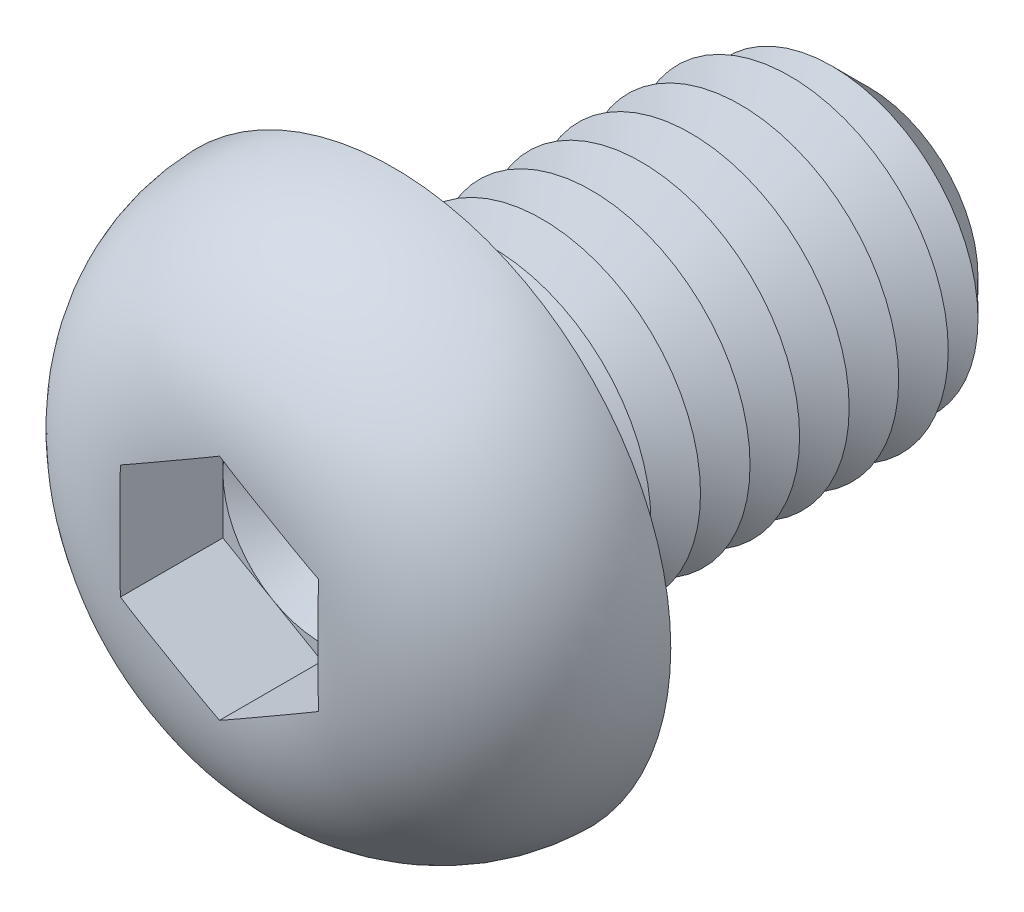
ISO-10303-21;
HEADER;
FILE_DESCRIPTION(('STEP AP214'),'2;1');
FILE_NAME('part.step','',(''),(''),'','','');
FILE_SCHEMA(('AUTOMOTIVE_DESIGN { 1 0 10303 214 1 1 1 1 }'));
ENDSEC;
DATA;
#1=APPLICATION_CONTEXT('core data for automotive mechanical design processes');
#2=APPLICATION_PROTOCOL_DEFINITION('international standard','automotive_design',2000,#1);
#3=PRODUCT_CONTEXT('',#1,'mechanical');
#4=PRODUCT('Part','Part','',(#3));
#5=PRODUCT_RELATED_PRODUCT_CATEGORY('part','',(#4));
#6=PRODUCT_DEFINITION_FORMATION('','',#4);
#7=PRODUCT_DEFINITION_CONTEXT('part definition',#1,'design');
#8=PRODUCT_DEFINITION('design','',#6,#7);
#9=PRODUCT_DEFINITION_SHAPE('','',#8);
#10=(LENGTH_UNIT() NAMED_UNIT(*) SI_UNIT(.MILLI.,.METRE.));
#11=(NAMED_UNIT(*) PLANE_ANGLE_UNIT() SI_UNIT($,.RADIAN.));
#12=(NAMED_UNIT(*) SI_UNIT($,.STERADIAN.) SOLID_ANGLE_UNIT());
#13=UNCERTAINTY_MEASURE_WITH_UNIT(LENGTH_MEASURE(1.E-05),#10,'distance_accuracy_value','');
#14=(GEOMETRIC_REPRESENTATION_CONTEXT(3) GLOBAL_UNCERTAINTY_ASSIGNED_CONTEXT((#13)) GLOBAL_UNIT_ASSIGNED_CONTEXT((#10,
#11,#12)) REPRESENTATION_CONTEXT('',''));
#15=CARTESIAN_POINT('',(0.,0.,0.));
#16=DIRECTION('',(0.,0.,1.));
#17=DIRECTION('',(1.,0.,0.));
#18=AXIS2_PLACEMENT_3D('',#15,#16,#17);
#19=CARTESIAN_POINT('',(0.,0.,1.8));
#20=DIRECTION('',(0.,0.,1.));
#21=DIRECTION('',(1.,0.,0.));
#22=AXIS2_PLACEMENT_3D('',#19,#20,#21);
#23=PLANE('',#22);
#24=CARTESIAN_POINT('',(0.,0.,1.8));
#25=DIRECTION('',(0.,0.,1.));
#26=DIRECTION('',(1.,0.,0.));
#27=AXIS2_PLACEMENT_3D('',#24,#25,#26);
#28=CIRCLE('',#27,2.5);
#29=CARTESIAN_POINT('',(2.5,0.,1.8));
#30=VERTEX_POINT('',#29);
#31=CARTESIAN_POINT('',(1.25,2.1650635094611,1.8));
#32=VERTEX_POINT('',#31);
#33=EDGE_CURVE('E153',#30,#32,#28,.T.);
#34=ORIENTED_EDGE('',*,*,#33,.F.);
#35=DIRECTION('',(0.,1.,0.));
#36=VECTOR('',#35,1.);
#37=CARTESIAN_POINT('',(2.5,-1.44337567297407,1.8));
#38=LINE('',#37,#36);
#39=CARTESIAN_POINT('',(2.5,1.44337567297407,1.8));
#40=VERTEX_POINT('',#39);
#41=EDGE_CURVE('E176',#30,#40,#38,.T.);
#42=ORIENTED_EDGE('',*,*,#41,.T.);
#43=DIRECTION('',(-0.866025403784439,0.5,0.));
#44=VECTOR('',#43,1.);
#45=CARTESIAN_POINT('',(2.5,1.44337567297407,1.8));
#46=LINE('',#45,#44);
#47=EDGE_CURVE('E172',#40,#32,#46,.T.);
#48=ORIENTED_EDGE('',*,*,#47,.T.);
#49=EDGE_LOOP('',(#34,#42,#48));
#50=FACE_BOUND('',#49,.T.);
#51=ADVANCED_FACE('F39',(#50),#23,.T.);
#52=CARTESIAN_POINT('',(0.,0.,1.8));
#53=DIRECTION('',(0.,0.,1.));
#54=DIRECTION('',(1.,0.,0.));
#55=AXIS2_PLACEMENT_3D('',#52,#53,#54);
#56=CIRCLE('',#55,2.5);
#57=CARTESIAN_POINT('',(-1.25,2.1650635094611,1.8));
#58=VERTEX_POINT('',#57);
#59=EDGE_CURVE('E11',#32,#58,#56,.T.);
#60=ORIENTED_EDGE('',*,*,#59,.F.);
#61=CARTESIAN_POINT('',(0.,2.88675134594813,1.8));
#62=VERTEX_POINT('',#61);
#63=EDGE_CURVE('E166',#32,#62,#46,.T.);
#64=ORIENTED_EDGE('',*,*,#63,.T.);
#65=DIRECTION('',(-0.866025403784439,-0.5,0.));
#66=VECTOR('',#65,1.);
#67=CARTESIAN_POINT('',(0.,2.88675134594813,1.8));
#68=LINE('',#67,#66);
#69=EDGE_CURVE('E167',#62,#58,#68,.T.);
#70=ORIENTED_EDGE('',*,*,#69,.T.);
#71=EDGE_LOOP('',(#60,#64,#70));
#72=FACE_BOUND('',#71,.T.);
#73=ADVANCED_FACE('F165',(#72),#23,.T.);
#74=CARTESIAN_POINT('',(-2.5,0.,1.8));
#75=VERTEX_POINT('',#74);
#76=EDGE_CURVE('E49',#58,#75,#56,.T.);
#77=ORIENTED_EDGE('',*,*,#76,.F.);
#78=CARTESIAN_POINT('',(-2.5,1.44337567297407,1.8));
#79=VERTEX_POINT('',#78);
#80=EDGE_CURVE('E179',#58,#79,#68,.T.);
#81=ORIENTED_EDGE('',*,*,#80,.T.);
#82=DIRECTION('',(0.,-1.,0.));
#83=VECTOR('',#82,1.);
#84=CARTESIAN_POINT('',(-2.5,1.44337567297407,1.8));
#85=LINE('',#84,#83);
#86=EDGE_CURVE('E190',#79,#75,#85,.T.);
#87=ORIENTED_EDGE('',*,*,#86,.T.);
#88=EDGE_LOOP('',(#77,#81,#87));
#89=FACE_BOUND('',#88,.T.);
#90=ADVANCED_FACE('F443',(#89),#23,.T.);
#91=CARTESIAN_POINT('',(-1.25,-2.1650635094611,1.8));
#92=VERTEX_POINT('',#91);
#93=EDGE_CURVE('E427',#75,#92,#56,.T.);
#94=ORIENTED_EDGE('',*,*,#93,.F.);
#95=CARTESIAN_POINT('',(-2.5,-1.44337567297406,1.8));
#96=VERTEX_POINT('',#95);
#97=EDGE_CURVE('E189',#75,#96,#85,.T.);
#98=ORIENTED_EDGE('',*,*,#97,.T.);
#99=DIRECTION('',(0.866025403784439,-0.5,0.));
#100=VECTOR('',#99,1.);
#101=CARTESIAN_POINT('',(-2.5,-1.44337567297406,1.8));
#102=LINE('',#101,#100);
#103=EDGE_CURVE('E195',#96,#92,#102,.T.);
#104=ORIENTED_EDGE('',*,*,#103,.T.);
#105=EDGE_LOOP('',(#94,#98,#104));
#106=FACE_BOUND('',#105,.T.);
#107=ADVANCED_FACE('F437',(#106),#23,.T.);
#108=CARTESIAN_POINT('',(1.25,-2.1650635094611,1.8));
#109=VERTEX_POINT('',#108);
#110=EDGE_CURVE('E56',#92,#109,#56,.T.);
#111=ORIENTED_EDGE('',*,*,#110,.F.);
#112=CARTESIAN_POINT('',(0.,-2.88675134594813,1.8));
#113=VERTEX_POINT('',#112);
#114=EDGE_CURVE('E194',#92,#113,#102,.T.);
#115=ORIENTED_EDGE('',*,*,#114,.T.);
#116=DIRECTION('',(0.866025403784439,0.5,0.));
#117=VECTOR('',#116,1.);
#118=CARTESIAN_POINT('',(0.,-2.88675134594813,1.8));
#119=LINE('',#118,#117);
#120=EDGE_CURVE('E200',#113,#109,#119,.T.);
#121=ORIENTED_EDGE('',*,*,#120,.T.);
#122=EDGE_LOOP('',(#111,#115,#121));
#123=FACE_BOUND('',#122,.T.);
#124=ADVANCED_FACE('F475',(#123),#23,.T.);
#125=CARTESIAN_POINT('',(0.,0.,-12.));
#126=DIRECTION('',(0.,0.,1.));
#127=DIRECTION('',(1.,0.,0.));
#128=AXIS2_PLACEMENT_3D('',#125,#126,#127);
#129=CYLINDRICAL_SURFACE('',#128,4.);
#130=CARTESIAN_POINT('',(0.,0.,-0.5));
#131=DIRECTION('',(0.,0.,1.));
#132=DIRECTION('',(1.,0.,0.));
#133=AXIS2_PLACEMENT_3D('',#130,#131,#132);
#134=CIRCLE('',#133,4.);
#135=CARTESIAN_POINT('',(4.,0.,-0.5));
#136=VERTEX_POINT('',#135);
#137=EDGE_CURVE('E410',#136,#136,#134,.F.);
#138=ORIENTED_EDGE('',*,*,#137,.T.);
#139=EDGE_LOOP('',(#138));
#140=FACE_BOUND('',#139,.T.);
#141=CARTESIAN_POINT('',(0.,0.,-1.25));
#142=DIRECTION('',(0.,0.,1.));
#143=DIRECTION('',(1.,0.,0.));
#144=AXIS2_PLACEMENT_3D('',#141,#142,#143);
#145=CIRCLE('',#144,4.00000000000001);
#146=CARTESIAN_POINT('',(4.00000000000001,0.,-1.25));
#147=VERTEX_POINT('',#146);
#148=EDGE_CURVE('E185',#147,#147,#145,.T.);
#149=ORIENTED_EDGE('',*,*,#148,.T.);
#150=EDGE_LOOP('',(#149));
#151=FACE_BOUND('',#150,.T.);
#152=ADVANCED_FACE('F470',(#140,#151),#129,.T.);
#153=CARTESIAN_POINT('',(0.,7.,0.));
#154=DIRECTION('',(0.,0.,1.));
#155=DIRECTION('',(1.,0.,0.));
#156=AXIS2_PLACEMENT_3D('',#153,#154,#155);
#157=PLANE('',#156);
#158=CARTESIAN_POINT('',(0.,0.,0.));
#159=DIRECTION('',(0.,0.,1.));
#160=DIRECTION('',(1.,0.,0.));
#161=AXIS2_PLACEMENT_3D('',#158,#159,#160);
#162=CIRCLE('',#161,4.5);
#163=CARTESIAN_POINT('',(4.5,0.,0.));
#164=VERTEX_POINT('',#163);
#165=EDGE_CURVE('E419',#164,#164,#162,.T.);
#166=ORIENTED_EDGE('',*,*,#165,.T.);
#167=EDGE_LOOP('',(#166));
#168=FACE_BOUND('',#167,.T.);
#169=CARTESIAN_POINT('',(0.,0.,0.));
#170=DIRECTION('',(0.,0.,1.));
#171=DIRECTION('',(1.,0.,0.));
#172=AXIS2_PLACEMENT_3D('',#169,#170,#171);
#173=CIRCLE('',#172,7.);
#174=CARTESIAN_POINT('',(7.,0.,0.));
#175=VERTEX_POINT('',#174);
#176=EDGE_CURVE('E211',#175,#175,#173,.T.);
#177=ORIENTED_EDGE('',*,*,#176,.F.);
#178=EDGE_LOOP('',(#177));
#179=FACE_BOUND('',#178,.T.);
#180=ADVANCED_FACE('F468',(#168,#179),#157,.F.);
#181=CARTESIAN_POINT('',(0.,0.,-0.1));
#182=DIRECTION('',(0.,0.,1.));
#183=DIRECTION('',(1.,0.,0.));
#184=AXIS2_PLACEMENT_3D('',#181,#182,#183);
#185=DEGENERATE_TOROIDAL_SURFACE('',#184,2.5011112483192,4.5,.T.);
#186=CARTESIAN_POINT('',(1.31456088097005,2.12778926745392,4.4));
#187=DIRECTION('',(-0.866025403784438,0.500000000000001,0.));
#188=VECTOR('',#187,1.);
#189=LINE('',#186,#188);
#190=CARTESIAN_POINT('',(1.31456088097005,2.12778926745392,4.4));
#191=VERTEX_POINT('',#190);
#192=CARTESIAN_POINT('',(1.18543911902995,2.20233775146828,4.4));
#193=VERTEX_POINT('',#192);
#194=EDGE_CURVE('E398',#191,#193,#189,.T.);
#195=ORIENTED_EDGE('',*,*,#194,.F.);
#196=CARTESIAN_POINT('',(-0.000200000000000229,2.88686681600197,4.38343536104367));
#197=CARTESIAN_POINT('',(0.103935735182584,2.82674402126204,4.38859262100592));
#198=CARTESIAN_POINT('',(0.208111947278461,2.76659785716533,4.39207570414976));
#199=CARTESIAN_POINT('',(0.416486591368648,2.64629270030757,4.39683754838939));
#200=CARTESIAN_POINT('',(0.520685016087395,2.58613371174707,4.39811670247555));
#201=CARTESIAN_POINT('',(0.729066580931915,2.46582455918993,4.3996156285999));
#202=CARTESIAN_POINT('',(0.833249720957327,2.40567439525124,4.39983556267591));
#203=CARTESIAN_POINT('',(1.04162190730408,2.2853706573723,4.4000276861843));
#204=CARTESIAN_POINT('',(1.14581095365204,2.2252170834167,4.39999986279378));
#205=CARTESIAN_POINT('',(1.35418904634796,2.10490993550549,4.39999986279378));
#206=CARTESIAN_POINT('',(1.45837809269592,2.04475636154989,4.4000276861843));
#207=CARTESIAN_POINT('',(1.66675027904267,1.92445262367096,4.39983556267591));
#208=CARTESIAN_POINT('',(1.77093341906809,1.86430245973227,4.3996156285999));
#209=CARTESIAN_POINT('',(1.97931498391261,1.74399330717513,4.39811670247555));
#210=CARTESIAN_POINT('',(2.08351340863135,1.68383431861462,4.39683754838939));
#211=CARTESIAN_POINT('',(2.29188805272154,1.56352916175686,4.39207570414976));
#212=CARTESIAN_POINT('',(2.39606426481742,1.50338299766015,4.38859262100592));
#213=CARTESIAN_POINT('',(2.5002,1.44326020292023,4.38343536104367));
#214=B_SPLINE_CURVE_WITH_KNOTS('',3,(#196,#197,#198,#199,#200,#201,#202,#203,#204,#205,#206,
#207,#208,#209,#210,#211,#212,#213),.UNSPECIFIED.,.F.,.F.,(4,2,2,2,2,2,2,2,4),(0.,
0.361022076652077,0.721979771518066,1.08288224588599,1.44380339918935,1.80472455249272,
2.16562702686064,2.52658472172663,2.88760679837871),.UNSPECIFIED.);
#215=CARTESIAN_POINT('',(2.5,1.44337567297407,4.38344529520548));
#216=VERTEX_POINT('',#215);
#217=EDGE_CURVE('E355',#191,#216,#214,.T.);
#218=ORIENTED_EDGE('',*,*,#217,.T.);
#219=CARTESIAN_POINT('',(2.5,0.,4.39999986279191));
#220=CARTESIAN_POINT('',(2.5,-0.104697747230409,4.39999811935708));
#221=CARTESIAN_POINT('',(2.5,-0.209395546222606,4.40001551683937));
#222=CARTESIAN_POINT('',(2.5,-0.418792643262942,4.39990807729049));
#223=CARTESIAN_POINT('',(2.5,-0.52349194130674,4.39978323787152));
#224=CARTESIAN_POINT('',(2.5,-0.732936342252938,4.39891238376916));
#225=CARTESIAN_POINT('',(2.5,-0.837681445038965,4.39816609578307));
#226=CARTESIAN_POINT('',(2.5,-1.04715282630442,4.39536239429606));
#227=CARTESIAN_POINT('',(2.5,-1.15187910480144,4.39330498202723));
#228=CARTESIAN_POINT('',(2.5,-1.46476484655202,4.38400647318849));
#229=CARTESIAN_POINT('',(2.5,-1.67286375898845,4.37365196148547));
#230=CARTESIAN_POINT('',(2.5,-2.08783281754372,4.33852954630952));
#231=CARTESIAN_POINT('',(2.5,-2.29470379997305,4.31377296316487));
#232=CARTESIAN_POINT('',(2.5,-2.64451002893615,4.25536510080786));
#233=CARTESIAN_POINT('',(2.5,-2.78823975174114,4.22651785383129));
#234=CARTESIAN_POINT('',(2.5,-3.073224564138,4.15827060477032));
#235=CARTESIAN_POINT('',(2.5,-3.21447933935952,4.11886927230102));
#236=CARTESIAN_POINT('',(2.5,-3.49353952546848,4.02870287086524));
#237=CARTESIAN_POINT('',(2.5,-3.6313402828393,3.97792330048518));
#238=CARTESIAN_POINT('',(2.5,-3.90204977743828,3.86463774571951));
#239=CARTESIAN_POINT('',(2.5,-4.0349587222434,3.8021322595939));
#240=CARTESIAN_POINT('',(2.5,-4.2956525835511,3.66474880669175));
#241=CARTESIAN_POINT('',(2.5,-4.42338586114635,3.58977252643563));
#242=CARTESIAN_POINT('',(2.5,-4.67118559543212,3.42803136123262));
#243=CARTESIAN_POINT('',(2.5,-4.79125159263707,3.3412657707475));
#244=CARTESIAN_POINT('',(2.5,-5.02233156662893,3.15645800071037));
#245=CARTESIAN_POINT('',(2.5,-5.13334771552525,3.05841854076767));
#246=CARTESIAN_POINT('',(2.5,-5.34506083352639,2.85177471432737));
#247=CARTESIAN_POINT('',(2.5,-5.44575933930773,2.74317192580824));
#248=CARTESIAN_POINT('',(2.5,-5.62335564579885,2.53102225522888));
#249=CARTESIAN_POINT('',(2.5,-5.70164721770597,2.42863868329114));
#250=CARTESIAN_POINT('',(2.5,-5.84882394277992,2.21725758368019));
#251=CARTESIAN_POINT('',(2.5,-5.91770588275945,2.10825781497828));
#252=CARTESIAN_POINT('',(2.5,-6.04532926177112,1.88460009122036));
#253=CARTESIAN_POINT('',(2.5,-6.1040794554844,1.76994713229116));
#254=CARTESIAN_POINT('',(2.5,-6.21098181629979,1.53574793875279));
#255=CARTESIAN_POINT('',(2.5,-6.25913021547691,1.41619998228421));
#256=CARTESIAN_POINT('',(2.5,-6.34173830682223,1.18065209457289));
#257=CARTESIAN_POINT('',(2.5,-6.37685491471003,1.06488207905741));
#258=CARTESIAN_POINT('',(2.5,-6.43703913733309,0.830714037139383));
#259=CARTESIAN_POINT('',(2.5,-6.46210319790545,0.712315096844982));
#260=CARTESIAN_POINT('',(2.5,-6.50194044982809,0.473848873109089));
#261=CARTESIAN_POINT('',(2.5,-6.51671856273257,0.353782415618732));
#262=CARTESIAN_POINT('',(2.5,-6.53588982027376,0.112808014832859));
#263=CARTESIAN_POINT('',(2.5,-6.54027911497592,-0.00810022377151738));
#264=CARTESIAN_POINT('',(2.5,-6.53779027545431,-0.365870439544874));
#265=CARTESIAN_POINT('',(2.5,-6.51607942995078,-0.602790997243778));
#266=CARTESIAN_POINT('',(2.5,-6.43310265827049,-1.06957107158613));
#267=CARTESIAN_POINT('',(2.5,-6.3718398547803,-1.29943114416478));
#268=CARTESIAN_POINT('',(2.5,-6.25195024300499,-1.63390601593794));
#269=CARTESIAN_POINT('',(2.5,-6.20730237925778,-1.74371189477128));
#270=CARTESIAN_POINT('',(2.5,-6.10902350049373,-1.95921136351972));
#271=CARTESIAN_POINT('',(2.5,-6.05539567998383,-2.06490639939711));
#272=CARTESIAN_POINT('',(2.5,-5.93955620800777,-2.27152527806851));
#273=CARTESIAN_POINT('',(2.5,-5.87734126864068,-2.37244727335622));
#274=CARTESIAN_POINT('',(2.5,-5.7448545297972,-2.56880727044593));
#275=CARTESIAN_POINT('',(2.5,-5.67458537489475,-2.6642470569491));
#276=CARTESIAN_POINT('',(2.5,-5.52523018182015,-2.85070592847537));
#277=CARTESIAN_POINT('',(2.5,-5.44601185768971,-2.94161901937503));
#278=CARTESIAN_POINT('',(2.5,-5.28044044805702,-3.11663859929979));
#279=CARTESIAN_POINT('',(2.5,-5.194089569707,-3.2007471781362));
#280=CARTESIAN_POINT('',(2.5,-5.01485870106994,-3.36178408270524));
#281=CARTESIAN_POINT('',(2.5,-4.92197538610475,-3.43870870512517));
#282=CARTESIAN_POINT('',(2.5,-4.73045535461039,-3.58495812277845));
#283=CARTESIAN_POINT('',(2.5,-4.6318202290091,-3.65428500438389));
#284=CARTESIAN_POINT('',(2.5,-4.4247626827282,-3.78818551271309));
#285=CARTESIAN_POINT('',(2.5,-4.31609824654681,-3.85238474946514));
#286=CARTESIAN_POINT('',(2.5,-4.0940582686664,-3.97208975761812));
#287=CARTESIAN_POINT('',(2.5,-3.98068153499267,-4.02759331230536));
#288=CARTESIAN_POINT('',(2.5,-3.75029026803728,-4.12981004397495));
#289=CARTESIAN_POINT('',(2.5,-3.63328275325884,-4.17653908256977));
#290=CARTESIAN_POINT('',(2.5,-3.39631992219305,-4.2614893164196));
#291=CARTESIAN_POINT('',(2.5,-3.27636651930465,-4.29971587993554));
#292=CARTESIAN_POINT('',(2.5,-3.00446622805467,-4.37644925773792));
#293=CARTESIAN_POINT('',(2.5,-2.85188931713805,-4.41272455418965));
#294=CARTESIAN_POINT('',(2.5,-2.54443794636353,-4.47385449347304));
#295=CARTESIAN_POINT('',(2.5,-2.3895624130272,-4.49870361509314));
#296=CARTESIAN_POINT('',(2.5,-2.07807451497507,-4.53870829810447));
#297=CARTESIAN_POINT('',(2.5,-1.92145805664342,-4.55383091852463));
#298=CARTESIAN_POINT('',(2.5,-1.60772330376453,-4.57647936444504));
#299=CARTESIAN_POINT('',(2.5,-1.45060502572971,-4.58400543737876));
#300=CARTESIAN_POINT('',(2.5,-1.13432460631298,-4.59416656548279));
#301=CARTESIAN_POINT('',(2.5,-0.975160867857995,-4.59674096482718));
#302=CARTESIAN_POINT('',(2.5,-0.656826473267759,-4.59957813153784));
#303=CARTESIAN_POINT('',(2.5,-0.497655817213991,-4.59984092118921));
#304=CARTESIAN_POINT('',(2.5,-0.179547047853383,-4.60005428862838));
#305=CARTESIAN_POINT('',(2.5,-0.02060893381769,-4.60000532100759));
#306=CARTESIAN_POINT('',(2.5,0.297265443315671,-4.59999304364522));
#307=CARTESIAN_POINT('',(2.5,0.456201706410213,-4.60002973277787));
#308=CARTESIAN_POINT('',(2.5,0.70967559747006,-4.59902611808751));
#309=CARTESIAN_POINT('',(2.5,0.804213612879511,-4.59841616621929));
#310=CARTESIAN_POINT('',(2.5,0.99327694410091,-4.59620676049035));
#311=CARTESIAN_POINT('',(2.5,1.08780225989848,-4.59460730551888));
#312=CARTESIAN_POINT('',(2.5,1.37137837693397,-4.58746770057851));
#313=CARTESIAN_POINT('',(2.5,1.56039301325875,-4.57958602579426));
#314=CARTESIAN_POINT('',(2.5,1.93609462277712,-4.55305686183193));
#315=CARTESIAN_POINT('',(2.5,2.12278756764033,-4.53450331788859));
#316=CARTESIAN_POINT('',(2.5,2.49421016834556,-4.48296248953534));
#317=CARTESIAN_POINT('',(2.5,2.67894050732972,-4.44998040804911));
#318=CARTESIAN_POINT('',(2.5,2.99962701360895,-4.37718406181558));
#319=CARTESIAN_POINT('',(2.5,3.13641465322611,-4.34103978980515));
#320=CARTESIAN_POINT('',(2.5,3.40682838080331,-4.25834226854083));
#321=CARTESIAN_POINT('',(2.5,3.54045461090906,-4.21178948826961));
#322=CARTESIAN_POINT('',(2.5,3.80387940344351,-4.1076796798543));
#323=CARTESIAN_POINT('',(2.5,3.93366385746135,-4.05008679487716));
#324=CARTESIAN_POINT('',(2.5,4.18776789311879,-3.92385886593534));
#325=CARTESIAN_POINT('',(2.5,4.31208736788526,-3.85522360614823));
#326=CARTESIAN_POINT('',(2.5,4.55475418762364,-3.70660227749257));
#327=CARTESIAN_POINT('',(2.5,4.67306276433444,-3.62655275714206));
#328=CARTESIAN_POINT('',(2.5,4.90171316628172,-3.45576294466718));
#329=CARTESIAN_POINT('',(2.5,5.01205476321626,-3.36502234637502));
#330=CARTESIAN_POINT('',(2.5,5.22347091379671,-3.17353376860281));
#331=CARTESIAN_POINT('',(2.5,5.32455555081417,-3.07279693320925));
#332=CARTESIAN_POINT('',(2.5,5.51647993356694,-2.86200023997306));
#333=CARTESIAN_POINT('',(2.5,5.6073208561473,-2.75194145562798));
#334=CARTESIAN_POINT('',(2.5,5.76832451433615,-2.53607083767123));
#335=CARTESIAN_POINT('',(2.5,5.83966300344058,-2.4311337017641));
#336=CARTESIAN_POINT('',(2.5,5.97282702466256,-2.2153291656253));
#337=CARTESIAN_POINT('',(2.5,6.03464926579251,-2.10445973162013));
#338=CARTESIAN_POINT('',(2.5,6.14815657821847,-1.87771731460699));
#339=CARTESIAN_POINT('',(2.5,6.19984675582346,-1.76184688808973));
#340=CARTESIAN_POINT('',(2.5,6.29267395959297,-1.52590109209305));
#341=CARTESIAN_POINT('',(2.5,6.33380720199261,-1.40582423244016));
#342=CARTESIAN_POINT('',(2.5,6.40328888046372,-1.16869740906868));
#343=CARTESIAN_POINT('',(2.5,6.43218419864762,-1.05180738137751));
#344=CARTESIAN_POINT('',(2.5,6.47988151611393,-0.815941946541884));
#345=CARTESIAN_POINT('',(2.5,6.49867991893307,-0.696965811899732));
#346=CARTESIAN_POINT('',(2.5,6.52599950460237,-0.457898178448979));
#347=CARTESIAN_POINT('',(2.5,6.53452634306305,-0.337807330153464));
#348=CARTESIAN_POINT('',(2.5,6.54126106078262,-0.0973214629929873));
#349=CARTESIAN_POINT('',(2.5,6.5394651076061,0.023073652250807));
#350=CARTESIAN_POINT('',(2.5,6.51879545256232,0.379398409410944));
#351=CARTESIAN_POINT('',(2.5,6.48510560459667,0.614630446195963));
#352=CARTESIAN_POINT('',(2.5,6.37872360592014,1.07608887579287));
#353=CARTESIAN_POINT('',(2.5,6.30603128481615,1.3023152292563));
#354=CARTESIAN_POINT('',(2.5,6.16957161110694,1.63028303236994));
#355=CARTESIAN_POINT('',(2.5,6.11941470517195,1.7378698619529));
#356=CARTESIAN_POINT('',(2.5,6.01034124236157,1.94849153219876));
#357=CARTESIAN_POINT('',(2.5,5.9514277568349,2.05152795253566));
#358=CARTESIAN_POINT('',(2.5,5.82528890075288,2.25240256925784));
#359=CARTESIAN_POINT('',(2.5,5.75806159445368,2.35023954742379));
#360=CARTESIAN_POINT('',(2.5,5.61585543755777,2.54005689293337));
#361=CARTESIAN_POINT('',(2.5,5.54087908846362,2.63203913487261));
#362=CARTESIAN_POINT('',(2.5,5.38212190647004,2.81146438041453));
#363=CARTESIAN_POINT('',(2.5,5.29819182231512,2.89877528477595));
#364=CARTESIAN_POINT('',(2.5,5.12353712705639,3.06625194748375));
#365=CARTESIAN_POINT('',(2.5,5.03281455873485,3.14641983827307));
#366=CARTESIAN_POINT('',(2.5,4.84518171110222,3.29930665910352));
#367=CARTESIAN_POINT('',(2.5,4.74826657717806,3.37201962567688));
#368=CARTESIAN_POINT('',(2.5,4.54907485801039,3.50961479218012));
#369=CARTESIAN_POINT('',(2.5,4.44679969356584,3.57449905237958));
#370=CARTESIAN_POINT('',(2.5,4.23202545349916,3.69953578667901));
#371=CARTESIAN_POINT('',(2.5,4.11927203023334,3.75925114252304));
#372=CARTESIAN_POINT('',(2.5,3.88947986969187,3.86977617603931));
#373=CARTESIAN_POINT('',(2.5,3.77244067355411,3.92058489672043));
#374=CARTESIAN_POINT('',(2.5,3.5351804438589,4.0133148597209));
#375=CARTESIAN_POINT('',(2.5,3.41496637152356,4.0552539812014));
#376=CARTESIAN_POINT('',(2.5,3.17195278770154,4.13067246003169));
#377=CARTESIAN_POINT('',(2.5,3.04915378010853,4.16415344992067));
#378=CARTESIAN_POINT('',(2.5,2.80683027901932,4.22194717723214));
#379=CARTESIAN_POINT('',(2.5,2.68738216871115,4.2465834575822));
#380=CARTESIAN_POINT('',(2.5,2.44729214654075,4.28920746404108));
#381=CARTESIAN_POINT('',(2.5,2.32664997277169,4.30719369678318));
#382=CARTESIAN_POINT('',(2.5,2.08450864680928,4.33736171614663));
#383=CARTESIAN_POINT('',(2.5,1.9630086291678,4.3495363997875));
#384=CARTESIAN_POINT('',(2.5,1.71961501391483,4.36908103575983));
#385=CARTESIAN_POINT('',(2.5,1.59772134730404,4.37645009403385));
#386=CARTESIAN_POINT('',(2.5,1.35283283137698,4.38761579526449));
#387=CARTESIAN_POINT('',(2.5,1.22983679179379,4.39138420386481));
#388=CARTESIAN_POINT('',(2.5,0.983808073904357,4.3965493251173));
#389=CARTESIAN_POINT('',(2.5,0.860775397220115,4.3979461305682));
#390=CARTESIAN_POINT('',(2.5,0.614783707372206,4.39958107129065));
#391=CARTESIAN_POINT('',(2.5,0.491824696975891,4.3998199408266));
#392=CARTESIAN_POINT('',(2.5,0.245910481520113,4.40003035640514));
#393=CARTESIAN_POINT('',(2.5,0.122955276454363,4.4000019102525));
#394=CARTESIAN_POINT('',(2.5,0.,4.39999986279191));
#395=B_SPLINE_CURVE_WITH_KNOTS('',3,(#219,#220,#221,#222,#223,#224,#225,#226,#227,#228,#229,
#230,#231,#232,#233,#234,#235,#236,#237,#238,#239,#240,#241,#242,#243,#244,#245,#246,#247,#248,
#249,#250,#251,#252,#253,#254,#255,#256,#257,#258,#259,#260,#261,#262,#263,#264,#265,#266,#267,
#268,#269,#270,#271,#272,#273,#274,#275,#276,#277,#278,#279,#280,#281,#282,#283,#284,#285,#286,
#287,#288,#289,#290,#291,#292,#293,#294,#295,#296,#297,#298,#299,#300,#301,#302,#303,#304,#305,
#306,#307,#308,#309,#310,#311,#312,#313,#314,#315,#316,#317,#318,#319,#320,#321,#322,#323,#324,
#325,#326,#327,#328,#329,#330,#331,#332,#333,#334,#335,#336,#337,#338,#339,#340,#341,#342,#343,
#344,#345,#346,#347,#348,#349,#350,#351,#352,#353,#354,#355,#356,#357,#358,#359,#360,#361,#362,
#363,#364,#365,#366,#367,#368,#369,#370,#371,#372,#373,#374,#375,#376,#377,#378,#379,#380,#381,
#382,#383,#384,#385,#386,#387,#388,#389,#390,#391,#392,#393,#394),.UNSPECIFIED.,.T.,.F.,(4,2,2,
2,2,2,2,2,2,2,2,2,2,2,2,2,2,2,2,2,2,2,2,2,2,2,2,2,2,2,2,2,2,2,2,2,2,2,2,2,2,2,2,2,2,2,2,2,2,2,2,
2,2,2,2,2,2,2,2,2,2,2,2,2,2,2,2,2,2,2,2,2,2,2,2,2,2,2,2,2,2,2,2,2,2,2,2,4),(0.,
0.314093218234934,0.62819170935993,0.942428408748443,1.25666481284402,1.88144147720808,
2.50572771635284,2.94516878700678,3.38466527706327,3.82472511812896,4.26476626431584,
4.70845695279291,5.15217420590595,5.59578464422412,6.03932891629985,6.42549664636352,
6.81179591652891,7.19775970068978,7.58386043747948,7.94635637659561,8.30898036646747,
8.67143073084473,9.03401539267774,9.74414367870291,10.4542159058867,10.8094792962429,
11.1646165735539,11.5198902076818,11.8750475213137,12.2363927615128,12.597626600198,
12.9590456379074,13.3203651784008,13.698597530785,14.0769261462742,14.4545641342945,
14.8319630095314,15.3019396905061,15.7721432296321,16.2439309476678,16.715703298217,
17.1932187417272,17.6707295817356,18.1475442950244,18.6243527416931,18.9079682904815,
19.1915841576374,19.7589248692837,20.3213460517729,20.8835645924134,21.3076400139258,
21.731696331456,22.1571540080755,22.5826200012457,23.0105507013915,23.4384936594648,
23.8659647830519,24.2933867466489,24.6735755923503,25.0538956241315,25.4340234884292,
25.8142874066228,26.1750761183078,26.5359932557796,26.8967115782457,27.2575638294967,
27.9668653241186,28.6761699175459,29.0319382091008,29.3875820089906,29.7433087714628,
30.0989210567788,30.4618400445,30.8246503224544,31.1877485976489,31.5507511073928,
31.9331198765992,32.3155297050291,32.6971611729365,33.0787189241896,33.4443988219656,
33.8101607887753,34.1763686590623,34.54264464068,34.9117697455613,35.2808804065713,
35.6497569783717,36.0186227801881),.UNSPECIFIED.);
#396=CARTESIAN_POINT('',(2.5,0.0745484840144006,4.4));
#397=VERTEX_POINT('',#396);
#398=EDGE_CURVE('E345',#216,#397,#395,.T.);
#399=ORIENTED_EDGE('',*,*,#398,.T.);
#400=CARTESIAN_POINT('',(2.5,-0.0745484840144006,4.4));
#401=DIRECTION('',(0.,1.,0.));
#402=VECTOR('',#401,1.);
#403=LINE('',#400,#402);
#404=CARTESIAN_POINT('',(2.5,-0.0745484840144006,4.4));
#405=VERTEX_POINT('',#404);
#406=EDGE_CURVE('E174',#405,#397,#403,.T.);
#407=ORIENTED_EDGE('',*,*,#406,.F.);
#408=CARTESIAN_POINT('',(2.5,-1.44337567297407,4.38344529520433));
#409=VERTEX_POINT('',#408);
#410=EDGE_CURVE('E356',#405,#409,#395,.T.);
#411=ORIENTED_EDGE('',*,*,#410,.T.);
#412=CARTESIAN_POINT('',(2.5002,-1.44326020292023,4.38343536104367));
#413=CARTESIAN_POINT('',(2.39606426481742,-1.50338299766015,4.38859262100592));
#414=CARTESIAN_POINT('',(2.29188805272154,-1.56352916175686,4.39207570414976));
#415=CARTESIAN_POINT('',(2.08351340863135,-1.68383431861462,4.39683754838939));
#416=CARTESIAN_POINT('',(1.9793149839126,-1.74399330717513,4.39811670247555));
#417=CARTESIAN_POINT('',(1.77093341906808,-1.86430245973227,4.3996156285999));
#418=CARTESIAN_POINT('',(1.66675027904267,-1.92445262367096,4.39983556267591));
#419=CARTESIAN_POINT('',(1.45837809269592,-2.04475636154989,4.4000276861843));
#420=CARTESIAN_POINT('',(1.35418904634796,-2.10490993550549,4.39999986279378));
#421=CARTESIAN_POINT('',(1.14581095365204,-2.2252170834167,4.39999986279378));
#422=CARTESIAN_POINT('',(1.04162190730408,-2.2853706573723,4.4000276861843));
#423=CARTESIAN_POINT('',(0.833249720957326,-2.40567439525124,4.39983556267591));
#424=CARTESIAN_POINT('',(0.729066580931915,-2.46582455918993,4.3996156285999));
#425=CARTESIAN_POINT('',(0.520685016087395,-2.58613371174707,4.39811670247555));
#426=CARTESIAN_POINT('',(0.416486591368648,-2.64629270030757,4.39683754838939));
#427=CARTESIAN_POINT('',(0.208111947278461,-2.76659785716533,4.39207570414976));
#428=CARTESIAN_POINT('',(0.103935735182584,-2.82674402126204,4.38859262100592));
#429=CARTESIAN_POINT('',(-0.000200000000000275,-2.88686681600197,4.38343536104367));
#430=B_SPLINE_CURVE_WITH_KNOTS('',3,(#412,#413,#414,#415,#416,#417,#418,#419,#420,#421,#422,
#423,#424,#425,#426,#427,#428,#429),.UNSPECIFIED.,.F.,.F.,(4,2,2,2,2,2,2,2,4),(0.,
0.361022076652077,0.721979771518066,1.08288224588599,1.44380339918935,1.80472455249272,
2.16562702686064,2.52658472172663,2.88760679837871),.UNSPECIFIED.);
#431=CARTESIAN_POINT('',(1.31456088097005,-2.12778926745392,4.4));
#432=VERTEX_POINT('',#431);
#433=EDGE_CURVE('E332',#409,#432,#430,.T.);
#434=ORIENTED_EDGE('',*,*,#433,.T.);
#435=CARTESIAN_POINT('',(1.18543911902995,-2.20233775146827,4.4));
#436=DIRECTION('',(0.866025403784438,0.500000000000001,0.));
#437=VECTOR('',#436,1.);
#438=LINE('',#435,#437);
#439=CARTESIAN_POINT('',(1.18543911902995,-2.20233775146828,4.4));
#440=VERTEX_POINT('',#439);
#441=EDGE_CURVE('E341',#440,#432,#438,.T.);
#442=ORIENTED_EDGE('',*,*,#441,.F.);
#443=CARTESIAN_POINT('',(0.,-2.88675134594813,4.38344529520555));
#444=VERTEX_POINT('',#443);
#445=EDGE_CURVE('E295',#440,#444,#430,.T.);
#446=ORIENTED_EDGE('',*,*,#445,.T.);
#447=CARTESIAN_POINT('',(0.00019999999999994,-2.88686681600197,4.38343536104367));
#448=CARTESIAN_POINT('',(-0.103935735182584,-2.82674402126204,4.38859262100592));
#449=CARTESIAN_POINT('',(-0.208111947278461,-2.76659785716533,4.39207570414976));
#450=CARTESIAN_POINT('',(-0.416486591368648,-2.64629270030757,4.39683754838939));
#451=CARTESIAN_POINT('',(-0.520685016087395,-2.58613371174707,4.39811670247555));
#452=CARTESIAN_POINT('',(-0.729066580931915,-2.46582455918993,4.3996156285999));
#453=CARTESIAN_POINT('',(-0.833249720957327,-2.40567439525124,4.39983556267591));
#454=CARTESIAN_POINT('',(-1.04162190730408,-2.2853706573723,4.4000276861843));
#455=CARTESIAN_POINT('',(-1.14581095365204,-2.2252170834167,4.39999986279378));
#456=CARTESIAN_POINT('',(-1.35418904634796,-2.10490993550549,4.39999986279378));
#457=CARTESIAN_POINT('',(-1.45837809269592,-2.04475636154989,4.4000276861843));
#458=CARTESIAN_POINT('',(-1.66675027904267,-1.92445262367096,4.39983556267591));
#459=CARTESIAN_POINT('',(-1.77093341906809,-1.86430245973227,4.3996156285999));
#460=CARTESIAN_POINT('',(-1.97931498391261,-1.74399330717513,4.39811670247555));
#461=CARTESIAN_POINT('',(-2.08351340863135,-1.68383431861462,4.39683754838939));
#462=CARTESIAN_POINT('',(-2.29188805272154,-1.56352916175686,4.39207570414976));
#463=CARTESIAN_POINT('',(-2.39606426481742,-1.50338299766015,4.38859262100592));
#464=CARTESIAN_POINT('',(-2.5002,-1.44326020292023,4.38343536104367));
#465=B_SPLINE_CURVE_WITH_KNOTS('',3,(#447,#448,#449,#450,#451,#452,#453,#454,#455,#456,#457,
#458,#459,#460,#461,#462,#463,#464),.UNSPECIFIED.,.F.,.F.,(4,2,2,2,2,2,2,2,4),(0.,
0.361022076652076,0.721979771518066,1.08288224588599,1.44380339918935,1.80472455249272,
2.16562702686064,2.52658472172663,2.88760679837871),.UNSPECIFIED.);
#466=CARTESIAN_POINT('',(-1.18543911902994,-2.20233775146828,4.4));
#467=VERTEX_POINT('',#466);
#468=EDGE_CURVE('E285',#444,#467,#465,.T.);
#469=ORIENTED_EDGE('',*,*,#468,.T.);
#470=CARTESIAN_POINT('',(-1.31456088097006,-2.12778926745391,4.4));
#471=DIRECTION('',(0.86602540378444,-0.499999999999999,0.));
#472=VECTOR('',#471,1.);
#473=LINE('',#470,#472);
#474=CARTESIAN_POINT('',(-1.31456088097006,-2.12778926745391,4.4));
#475=VERTEX_POINT('',#474);
#476=EDGE_CURVE('E885',#475,#467,#473,.T.);
#477=ORIENTED_EDGE('',*,*,#476,.F.);
#478=CARTESIAN_POINT('',(-2.5,-1.44337567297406,4.38344529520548));
#479=VERTEX_POINT('',#478);
#480=EDGE_CURVE('E296',#475,#479,#465,.T.);
#481=ORIENTED_EDGE('',*,*,#480,.T.);
#482=CARTESIAN_POINT('',(-2.5,0.,4.39999986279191));
#483=CARTESIAN_POINT('',(-2.5,0.104697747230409,4.39999811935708));
#484=CARTESIAN_POINT('',(-2.5,0.209395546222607,4.40001551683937));
#485=CARTESIAN_POINT('',(-2.5,0.418792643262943,4.39990807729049));
#486=CARTESIAN_POINT('',(-2.5,0.523491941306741,4.39978323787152));
#487=CARTESIAN_POINT('',(-2.5,0.732936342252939,4.39891238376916));
#488=CARTESIAN_POINT('',(-2.5,0.837681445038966,4.39816609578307));
#489=CARTESIAN_POINT('',(-2.5,1.04715282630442,4.39536239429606));
#490=CARTESIAN_POINT('',(-2.5,1.15187910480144,4.39330498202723));
#491=CARTESIAN_POINT('',(-2.5,1.46476484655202,4.38400647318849));
#492=CARTESIAN_POINT('',(-2.5,1.67286375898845,4.37365196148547));
#493=CARTESIAN_POINT('',(-2.5,2.08783281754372,4.33852954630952));
#494=CARTESIAN_POINT('',(-2.5,2.29470379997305,4.31377296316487));
#495=CARTESIAN_POINT('',(-2.5,2.64451002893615,4.25536510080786));
#496=CARTESIAN_POINT('',(-2.5,2.78823975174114,4.22651785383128));
#497=CARTESIAN_POINT('',(-2.5,3.073224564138,4.15827060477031));
#498=CARTESIAN_POINT('',(-2.5,3.21447933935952,4.11886927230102));
#499=CARTESIAN_POINT('',(-2.5,3.49353952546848,4.02870287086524));
#500=CARTESIAN_POINT('',(-2.5,3.6313402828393,3.97792330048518));
#501=CARTESIAN_POINT('',(-2.5,3.90204977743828,3.8646377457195));
#502=CARTESIAN_POINT('',(-2.5,4.0349587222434,3.8021322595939));
#503=CARTESIAN_POINT('',(-2.5,4.2956525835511,3.66474880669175));
#504=CARTESIAN_POINT('',(-2.5,4.42338586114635,3.58977252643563));
#505=CARTESIAN_POINT('',(-2.5,4.67118559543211,3.42803136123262));
#506=CARTESIAN_POINT('',(-2.5,4.79125159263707,3.3412657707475));
#507=CARTESIAN_POINT('',(-2.5,5.02233156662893,3.15645800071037));
#508=CARTESIAN_POINT('',(-2.5,5.13334771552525,3.05841854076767));
#509=CARTESIAN_POINT('',(-2.5,5.34506083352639,2.85177471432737));
#510=CARTESIAN_POINT('',(-2.5,5.44575933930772,2.74317192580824));
#511=CARTESIAN_POINT('',(-2.5,5.62335564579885,2.53102225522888));
#512=CARTESIAN_POINT('',(-2.5,5.70164721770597,2.42863868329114));
#513=CARTESIAN_POINT('',(-2.5,5.84882394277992,2.21725758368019));
#514=CARTESIAN_POINT('',(-2.5,5.91770588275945,2.10825781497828));
#515=CARTESIAN_POINT('',(-2.5,6.04532926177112,1.88460009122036));
#516=CARTESIAN_POINT('',(-2.5,6.1040794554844,1.76994713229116));
#517=CARTESIAN_POINT('',(-2.5,6.21098181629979,1.53574793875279));
#518=CARTESIAN_POINT('',(-2.5,6.25913021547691,1.41619998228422));
#519=CARTESIAN_POINT('',(-2.5,6.34173830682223,1.18065209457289));
#520=CARTESIAN_POINT('',(-2.5,6.37685491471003,1.06488207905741));
#521=CARTESIAN_POINT('',(-2.5,6.43703913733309,0.830714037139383));
#522=CARTESIAN_POINT('',(-2.5,6.46210319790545,0.712315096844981));
#523=CARTESIAN_POINT('',(-2.5,6.50194044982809,0.473848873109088));
#524=CARTESIAN_POINT('',(-2.5,6.51671856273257,0.35378241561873));
#525=CARTESIAN_POINT('',(-2.5,6.53588982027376,0.112808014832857));
#526=CARTESIAN_POINT('',(-2.5,6.54027911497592,-0.00810022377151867));
#527=CARTESIAN_POINT('',(-2.5,6.53779027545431,-0.365870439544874));
#528=CARTESIAN_POINT('',(-2.5,6.51607942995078,-0.602790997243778));
#529=CARTESIAN_POINT('',(-2.5,6.43310265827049,-1.06957107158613));
#530=CARTESIAN_POINT('',(-2.5,6.3718398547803,-1.29943114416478));
#531=CARTESIAN_POINT('',(-2.5,6.25195024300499,-1.63390601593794));
#532=CARTESIAN_POINT('',(-2.5,6.20730237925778,-1.74371189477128));
#533=CARTESIAN_POINT('',(-2.5,6.10902350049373,-1.95921136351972));
#534=CARTESIAN_POINT('',(-2.5,6.05539567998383,-2.06490639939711));
#535=CARTESIAN_POINT('',(-2.5,5.93955620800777,-2.27152527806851));
#536=CARTESIAN_POINT('',(-2.5,5.87734126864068,-2.37244727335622));
#537=CARTESIAN_POINT('',(-2.5,5.7448545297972,-2.56880727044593));
#538=CARTESIAN_POINT('',(-2.5,5.67458537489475,-2.6642470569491));
#539=CARTESIAN_POINT('',(-2.5,5.52523018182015,-2.85070592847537));
#540=CARTESIAN_POINT('',(-2.5,5.44601185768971,-2.94161901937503));
#541=CARTESIAN_POINT('',(-2.5,5.28044044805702,-3.11663859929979));
#542=CARTESIAN_POINT('',(-2.5,5.194089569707,-3.2007471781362));
#543=CARTESIAN_POINT('',(-2.5,5.01485870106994,-3.36178408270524));
#544=CARTESIAN_POINT('',(-2.5,4.92197538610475,-3.43870870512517));
#545=CARTESIAN_POINT('',(-2.5,4.73045535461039,-3.58495812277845));
#546=CARTESIAN_POINT('',(-2.5,4.6318202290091,-3.65428500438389));
#547=CARTESIAN_POINT('',(-2.5,4.4247626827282,-3.78818551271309));
#548=CARTESIAN_POINT('',(-2.5,4.31609824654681,-3.85238474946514));
#549=CARTESIAN_POINT('',(-2.5,4.0940582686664,-3.97208975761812));
#550=CARTESIAN_POINT('',(-2.5,3.98068153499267,-4.02759331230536));
#551=CARTESIAN_POINT('',(-2.5,3.75029026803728,-4.12981004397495));
#552=CARTESIAN_POINT('',(-2.5,3.63328275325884,-4.17653908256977));
#553=CARTESIAN_POINT('',(-2.5,3.39631992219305,-4.2614893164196));
#554=CARTESIAN_POINT('',(-2.5,3.27636651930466,-4.29971587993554));
#555=CARTESIAN_POINT('',(-2.5,3.00446622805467,-4.37644925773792));
#556=CARTESIAN_POINT('',(-2.5,2.85188931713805,-4.41272455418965));
#557=CARTESIAN_POINT('',(-2.5,2.54443794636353,-4.47385449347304));
#558=CARTESIAN_POINT('',(-2.5,2.3895624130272,-4.49870361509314));
#559=CARTESIAN_POINT('',(-2.5,2.07807451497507,-4.53870829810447));
#560=CARTESIAN_POINT('',(-2.5,1.92145805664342,-4.55383091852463));
#561=CARTESIAN_POINT('',(-2.5,1.60772330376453,-4.57647936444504));
#562=CARTESIAN_POINT('',(-2.5,1.45060502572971,-4.58400543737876));
#563=CARTESIAN_POINT('',(-2.5,1.13432460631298,-4.59416656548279));
#564=CARTESIAN_POINT('',(-2.5,0.975160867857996,-4.59674096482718));
#565=CARTESIAN_POINT('',(-2.5,0.65682647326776,-4.59957813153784));
#566=CARTESIAN_POINT('',(-2.5,0.497655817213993,-4.59984092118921));
#567=CARTESIAN_POINT('',(-2.5,0.179547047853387,-4.60005428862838));
#568=CARTESIAN_POINT('',(-2.5,0.0206089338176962,-4.60000532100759));
#569=CARTESIAN_POINT('',(-2.5,-0.297265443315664,-4.59999304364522));
#570=CARTESIAN_POINT('',(-2.5,-0.456201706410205,-4.60002973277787));
#571=CARTESIAN_POINT('',(-2.5,-0.709675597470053,-4.59902611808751));
#572=CARTESIAN_POINT('',(-2.5,-0.804213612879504,-4.59841616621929));
#573=CARTESIAN_POINT('',(-2.5,-0.993276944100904,-4.59620676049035));
#574=CARTESIAN_POINT('',(-2.5,-1.08780225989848,-4.59460730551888));
#575=CARTESIAN_POINT('',(-2.5,-1.37137837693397,-4.58746770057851));
#576=CARTESIAN_POINT('',(-2.5,-1.56039301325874,-4.57958602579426));
#577=CARTESIAN_POINT('',(-2.5,-1.93609462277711,-4.55305686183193));
#578=CARTESIAN_POINT('',(-2.5,-2.12278756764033,-4.53450331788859));
#579=CARTESIAN_POINT('',(-2.5,-2.49421016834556,-4.48296248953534));
#580=CARTESIAN_POINT('',(-2.5,-2.67894050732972,-4.44998040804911));
#581=CARTESIAN_POINT('',(-2.5,-2.99962701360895,-4.37718406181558));
#582=CARTESIAN_POINT('',(-2.5,-3.13641465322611,-4.34103978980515));
#583=CARTESIAN_POINT('',(-2.5,-3.40682838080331,-4.25834226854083));
#584=CARTESIAN_POINT('',(-2.5,-3.54045461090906,-4.21178948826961));
#585=CARTESIAN_POINT('',(-2.5,-3.8038794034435,-4.1076796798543));
#586=CARTESIAN_POINT('',(-2.5,-3.93366385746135,-4.05008679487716));
#587=CARTESIAN_POINT('',(-2.5,-4.18776789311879,-3.92385886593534));
#588=CARTESIAN_POINT('',(-2.5,-4.31208736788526,-3.85522360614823));
#589=CARTESIAN_POINT('',(-2.5,-4.55475418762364,-3.70660227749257));
#590=CARTESIAN_POINT('',(-2.5,-4.67306276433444,-3.62655275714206));
#591=CARTESIAN_POINT('',(-2.5,-4.90171316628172,-3.45576294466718));
#592=CARTESIAN_POINT('',(-2.5,-5.01205476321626,-3.36502234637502));
#593=CARTESIAN_POINT('',(-2.5,-5.2234709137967,-3.17353376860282));
#594=CARTESIAN_POINT('',(-2.5,-5.32455555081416,-3.07279693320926));
#595=CARTESIAN_POINT('',(-2.5,-5.51647993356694,-2.86200023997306));
#596=CARTESIAN_POINT('',(-2.5,-5.6073208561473,-2.75194145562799));
#597=CARTESIAN_POINT('',(-2.5,-5.76832451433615,-2.53607083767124));
#598=CARTESIAN_POINT('',(-2.5,-5.83966300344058,-2.4311337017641));
#599=CARTESIAN_POINT('',(-2.5,-5.97282702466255,-2.2153291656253));
#600=CARTESIAN_POINT('',(-2.5,-6.03464926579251,-2.10445973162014));
#601=CARTESIAN_POINT('',(-2.5,-6.14815657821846,-1.877717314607));
#602=CARTESIAN_POINT('',(-2.5,-6.19984675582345,-1.76184688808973));
#603=CARTESIAN_POINT('',(-2.5,-6.29267395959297,-1.52590109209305));
#604=CARTESIAN_POINT('',(-2.5,-6.33380720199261,-1.40582423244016));
#605=CARTESIAN_POINT('',(-2.5,-6.40328888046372,-1.16869740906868));
#606=CARTESIAN_POINT('',(-2.5,-6.43218419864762,-1.05180738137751));
#607=CARTESIAN_POINT('',(-2.5,-6.47988151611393,-0.815941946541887));
#608=CARTESIAN_POINT('',(-2.5,-6.49867991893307,-0.696965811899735));
#609=CARTESIAN_POINT('',(-2.5,-6.52599950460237,-0.457898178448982));
#610=CARTESIAN_POINT('',(-2.5,-6.53452634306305,-0.337807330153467));
#611=CARTESIAN_POINT('',(-2.5,-6.54126106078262,-0.09732146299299));
#612=CARTESIAN_POINT('',(-2.5,-6.5394651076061,0.0230736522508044));
#613=CARTESIAN_POINT('',(-2.5,-6.51879545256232,0.379398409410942));
#614=CARTESIAN_POINT('',(-2.5,-6.48510560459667,0.614630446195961));
#615=CARTESIAN_POINT('',(-2.5,-6.37872360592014,1.07608887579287));
#616=CARTESIAN_POINT('',(-2.5,-6.30603128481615,1.3023152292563));
#617=CARTESIAN_POINT('',(-2.5,-6.16957161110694,1.63028303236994));
#618=CARTESIAN_POINT('',(-2.5,-6.11941470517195,1.7378698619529));
#619=CARTESIAN_POINT('',(-2.5,-6.01034124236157,1.94849153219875));
#620=CARTESIAN_POINT('',(-2.5,-5.9514277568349,2.05152795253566));
#621=CARTESIAN_POINT('',(-2.5,-5.82528890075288,2.25240256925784));
#622=CARTESIAN_POINT('',(-2.5,-5.75806159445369,2.35023954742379));
#623=CARTESIAN_POINT('',(-2.5,-5.61585543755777,2.54005689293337));
#624=CARTESIAN_POINT('',(-2.5,-5.54087908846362,2.63203913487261));
#625=CARTESIAN_POINT('',(-2.5,-5.38212190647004,2.81146438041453));
#626=CARTESIAN_POINT('',(-2.5,-5.29819182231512,2.89877528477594));
#627=CARTESIAN_POINT('',(-2.5,-5.1235371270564,3.06625194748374));
#628=CARTESIAN_POINT('',(-2.5,-5.03281455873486,3.14641983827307));
#629=CARTESIAN_POINT('',(-2.5,-4.84518171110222,3.29930665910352));
#630=CARTESIAN_POINT('',(-2.5,-4.74826657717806,3.37201962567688));
#631=CARTESIAN_POINT('',(-2.5,-4.54907485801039,3.50961479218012));
#632=CARTESIAN_POINT('',(-2.5,-4.44679969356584,3.57449905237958));
#633=CARTESIAN_POINT('',(-2.5,-4.23202545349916,3.69953578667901));
#634=CARTESIAN_POINT('',(-2.5,-4.11927203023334,3.75925114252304));
#635=CARTESIAN_POINT('',(-2.5,-3.88947986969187,3.86977617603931));
#636=CARTESIAN_POINT('',(-2.5,-3.77244067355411,3.92058489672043));
#637=CARTESIAN_POINT('',(-2.5,-3.5351804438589,4.0133148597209));
#638=CARTESIAN_POINT('',(-2.5,-3.41496637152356,4.0552539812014));
#639=CARTESIAN_POINT('',(-2.5,-3.17195278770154,4.13067246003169));
#640=CARTESIAN_POINT('',(-2.5,-3.04915378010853,4.16415344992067));
#641=CARTESIAN_POINT('',(-2.5,-2.80683027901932,4.22194717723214));
#642=CARTESIAN_POINT('',(-2.5,-2.68738216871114,4.2465834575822));
#643=CARTESIAN_POINT('',(-2.5,-2.44729214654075,4.28920746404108));
#644=CARTESIAN_POINT('',(-2.5,-2.32664997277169,4.30719369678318));
#645=CARTESIAN_POINT('',(-2.5,-2.08450864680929,4.33736171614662));
#646=CARTESIAN_POINT('',(-2.5,-1.96300862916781,4.34953639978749));
#647=CARTESIAN_POINT('',(-2.5,-1.71961501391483,4.36908103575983));
#648=CARTESIAN_POINT('',(-2.5,-1.59772134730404,4.37645009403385));
#649=CARTESIAN_POINT('',(-2.5,-1.35283283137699,4.38761579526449));
#650=CARTESIAN_POINT('',(-2.5,-1.2298367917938,4.39138420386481));
#651=CARTESIAN_POINT('',(-2.5,-0.983808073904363,4.3965493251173));
#652=CARTESIAN_POINT('',(-2.5,-0.860775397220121,4.3979461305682));
#653=CARTESIAN_POINT('',(-2.5,-0.61478370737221,4.39958107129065));
#654=CARTESIAN_POINT('',(-2.5,-0.491824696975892,4.3998199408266));
#655=CARTESIAN_POINT('',(-2.5,-0.245910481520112,4.40003035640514));
#656=CARTESIAN_POINT('',(-2.5,-0.122955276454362,4.4000019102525));
#657=CARTESIAN_POINT('',(-2.5,0.,4.39999986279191));
#658=B_SPLINE_CURVE_WITH_KNOTS('',3,(#482,#483,#484,#485,#486,#487,#488,#489,#490,#491,#492,
#493,#494,#495,#496,#497,#498,#499,#500,#501,#502,#503,#504,#505,#506,#507,#508,#509,#510,#511,
#512,#513,#514,#515,#516,#517,#518,#519,#520,#521,#522,#523,#524,#525,#526,#527,#528,#529,#530,
#531,#532,#533,#534,#535,#536,#537,#538,#539,#540,#541,#542,#543,#544,#545,#546,#547,#548,#549,
#550,#551,#552,#553,#554,#555,#556,#557,#558,#559,#560,#561,#562,#563,#564,#565,#566,#567,#568,
#569,#570,#571,#572,#573,#574,#575,#576,#577,#578,#579,#580,#581,#582,#583,#584,#585,#586,#587,
#588,#589,#590,#591,#592,#593,#594,#595,#596,#597,#598,#599,#600,#601,#602,#603,#604,#605,#606,
#607,#608,#609,#610,#611,#612,#613,#614,#615,#616,#617,#618,#619,#620,#621,#622,#623,#624,#625,
#626,#627,#628,#629,#630,#631,#632,#633,#634,#635,#636,#637,#638,#639,#640,#641,#642,#643,#644,
#645,#646,#647,#648,#649,#650,#651,#652,#653,#654,#655,#656,#657),.UNSPECIFIED.,.T.,.F.,(4,2,2,
2,2,2,2,2,2,2,2,2,2,2,2,2,2,2,2,2,2,2,2,2,2,2,2,2,2,2,2,2,2,2,2,2,2,2,2,2,2,2,2,2,2,2,2,2,2,2,2,
2,2,2,2,2,2,2,2,2,2,2,2,2,2,2,2,2,2,2,2,2,2,2,2,2,2,2,2,2,2,2,2,2,2,2,2,4),(0.,
0.314093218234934,0.62819170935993,0.942428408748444,1.25666481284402,1.88144147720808,
2.50572771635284,2.94516878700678,3.38466527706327,3.82472511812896,4.26476626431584,
4.70845695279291,5.15217420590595,5.59578464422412,6.03932891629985,6.42549664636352,
6.8117959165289,7.19775970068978,7.58386043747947,7.94635637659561,8.30898036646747,
8.67143073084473,9.03401539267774,9.74414367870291,10.4542159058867,10.8094792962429,
11.1646165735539,11.5198902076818,11.8750475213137,12.2363927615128,12.597626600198,
12.9590456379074,13.3203651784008,13.698597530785,14.0769261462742,14.4545641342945,
14.8319630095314,15.3019396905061,15.7721432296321,16.2439309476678,16.715703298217,
17.1932187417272,17.6707295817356,18.1475442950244,18.6243527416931,18.9079682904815,
19.1915841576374,19.7589248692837,20.3213460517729,20.8835645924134,21.3076400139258,
21.731696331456,22.1571540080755,22.5826200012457,23.0105507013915,23.4384936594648,
23.8659647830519,24.2933867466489,24.6735755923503,25.0538956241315,25.4340234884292,
25.8142874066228,26.1750761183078,26.5359932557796,26.8967115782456,27.2575638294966,
27.9668653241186,28.6761699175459,29.0319382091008,29.3875820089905,29.7433087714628,
30.0989210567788,30.4618400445,30.8246503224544,31.1877485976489,31.5507511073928,
31.9331198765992,32.3155297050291,32.6971611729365,33.0787189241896,33.4443988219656,
33.8101607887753,34.1763686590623,34.5426446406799,34.9117697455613,35.2808804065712,
35.6497569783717,36.0186227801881),.UNSPECIFIED.);
#659=CARTESIAN_POINT('',(-2.5,-0.0745484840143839,4.4));
#660=VERTEX_POINT('',#659);
#661=EDGE_CURVE('E269',#479,#660,#658,.T.);
#662=ORIENTED_EDGE('',*,*,#661,.T.);
#663=CARTESIAN_POINT('',(-2.5,0.0745484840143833,4.4));
#664=DIRECTION('',(0.,-1.,0.));
#665=VECTOR('',#664,1.);
#666=LINE('',#663,#665);
#667=CARTESIAN_POINT('',(-2.5,0.0745484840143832,4.4));
#668=VERTEX_POINT('',#667);
#669=EDGE_CURVE('E281',#668,#660,#666,.T.);
#670=ORIENTED_EDGE('',*,*,#669,.F.);
#671=CARTESIAN_POINT('',(-2.5,1.44337567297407,4.38344529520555));
#672=VERTEX_POINT('',#671);
#673=EDGE_CURVE('E272',#668,#672,#658,.T.);
#674=ORIENTED_EDGE('',*,*,#673,.T.);
#675=CARTESIAN_POINT('',(-2.5002,1.44326020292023,4.38343536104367));
#676=CARTESIAN_POINT('',(-2.39606426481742,1.50338299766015,4.38859262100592));
#677=CARTESIAN_POINT('',(-2.29188805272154,1.56352916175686,4.39207570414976));
#678=CARTESIAN_POINT('',(-2.08351340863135,1.68383431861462,4.39683754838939));
#679=CARTESIAN_POINT('',(-1.97931498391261,1.74399330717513,4.39811670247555));
#680=CARTESIAN_POINT('',(-1.77093341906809,1.86430245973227,4.3996156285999));
#681=CARTESIAN_POINT('',(-1.66675027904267,1.92445262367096,4.39983556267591));
#682=CARTESIAN_POINT('',(-1.45837809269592,2.04475636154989,4.4000276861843));
#683=CARTESIAN_POINT('',(-1.35418904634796,2.10490993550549,4.39999986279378));
#684=CARTESIAN_POINT('',(-1.14581095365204,2.2252170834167,4.39999986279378));
#685=CARTESIAN_POINT('',(-1.04162190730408,2.2853706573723,4.4000276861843));
#686=CARTESIAN_POINT('',(-0.833249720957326,2.40567439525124,4.39983556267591));
#687=CARTESIAN_POINT('',(-0.729066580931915,2.46582455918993,4.3996156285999));
#688=CARTESIAN_POINT('',(-0.520685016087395,2.58613371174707,4.39811670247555));
#689=CARTESIAN_POINT('',(-0.416486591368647,2.64629270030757,4.39683754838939));
#690=CARTESIAN_POINT('',(-0.208111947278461,2.76659785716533,4.39207570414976));
#691=CARTESIAN_POINT('',(-0.103935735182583,2.82674402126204,4.38859262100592));
#692=CARTESIAN_POINT('',(0.000200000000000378,2.88686681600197,4.38343536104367));
#693=B_SPLINE_CURVE_WITH_KNOTS('',3,(#675,#676,#677,#678,#679,#680,#681,#682,#683,#684,#685,
#686,#687,#688,#689,#690,#691,#692),.UNSPECIFIED.,.F.,.F.,(4,2,2,2,2,2,2,2,4),(0.,
0.361022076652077,0.721979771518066,1.08288224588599,1.44380339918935,1.80472455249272,
2.16562702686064,2.52658472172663,2.88760679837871),.UNSPECIFIED.);
#694=CARTESIAN_POINT('',(-1.31456088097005,2.12778926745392,4.4));
#695=VERTEX_POINT('',#694);
#696=EDGE_CURVE('E276',#672,#695,#693,.T.);
#697=ORIENTED_EDGE('',*,*,#696,.T.);
#698=CARTESIAN_POINT('',(-1.18543911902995,2.20233775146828,4.4));
#699=DIRECTION('',(-0.866025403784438,-0.500000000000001,0.));
#700=VECTOR('',#699,1.);
#701=LINE('',#698,#700);
#702=CARTESIAN_POINT('',(-1.18543911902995,2.20233775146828,4.4));
#703=VERTEX_POINT('',#702);
#704=EDGE_CURVE('E449',#703,#695,#701,.T.);
#705=ORIENTED_EDGE('',*,*,#704,.F.);
#706=CARTESIAN_POINT('',(0.,2.88675134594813,4.38344529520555));
#707=VERTEX_POINT('',#706);
#708=EDGE_CURVE('E454',#703,#707,#693,.T.);
#709=ORIENTED_EDGE('',*,*,#708,.T.);
#710=EDGE_CURVE('E389',#707,#193,#214,.T.);
#711=ORIENTED_EDGE('',*,*,#710,.T.);
#712=EDGE_LOOP('',(#195,#218,#399,#407,#411,#434,#442,#446,#469,#477,#481,#662,#670,#674,#697,
#705,#709,#711));
#713=FACE_BOUND('',#712,.T.);
#714=ORIENTED_EDGE('',*,*,#176,.T.);
#715=EDGE_LOOP('',(#714));
#716=FACE_BOUND('',#715,.T.);
#717=ADVANCED_FACE('F240',(#713,#716),#185,.T.);
#718=CARTESIAN_POINT('',(2.5,1.44337567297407,1.8));
#719=DIRECTION('',(0.5,0.866025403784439,0.));
#720=DIRECTION('',(-0.866025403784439,0.5,0.));
#721=AXIS2_PLACEMENT_3D('',#718,#719,#720);
#722=PLANE('',#721);
#723=DIRECTION('',(0.,0.,1.));
#724=VECTOR('',#723,1.);
#725=CARTESIAN_POINT('',(0.,2.88675134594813,1.8));
#726=LINE('',#725,#724);
#727=EDGE_CURVE('E64',#62,#707,#726,.T.);
#728=ORIENTED_EDGE('',*,*,#727,.F.);
#729=ORIENTED_EDGE('',*,*,#63,.F.);
#730=ORIENTED_EDGE('',*,*,#47,.F.);
#731=DIRECTION('',(0.,0.,1.));
#732=VECTOR('',#731,1.);
#733=CARTESIAN_POINT('',(2.5,1.44337567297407,1.8));
#734=LINE('',#733,#732);
#735=EDGE_CURVE('E208',#40,#216,#734,.T.);
#736=ORIENTED_EDGE('',*,*,#735,.T.);
#737=ORIENTED_EDGE('',*,*,#217,.F.);
#738=ORIENTED_EDGE('',*,*,#194,.T.);
#739=ORIENTED_EDGE('',*,*,#710,.F.);
#740=EDGE_LOOP('',(#728,#729,#730,#736,#737,#738,#739));
#741=FACE_BOUND('',#740,.T.);
#742=ADVANCED_FACE('F170',(#741),#722,.F.);
#743=CARTESIAN_POINT('',(2.5,-1.44337567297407,1.8));
#744=DIRECTION('',(1.,0.,0.));
#745=DIRECTION('',(0.,0.,-1.));
#746=AXIS2_PLACEMENT_3D('',#743,#744,#745);
#747=PLANE('',#746);
#748=ORIENTED_EDGE('',*,*,#406,.T.);
#749=ORIENTED_EDGE('',*,*,#398,.F.);
#750=ORIENTED_EDGE('',*,*,#735,.F.);
#751=ORIENTED_EDGE('',*,*,#41,.F.);
#752=CARTESIAN_POINT('',(2.5,-1.44337567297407,1.8));
#753=VERTEX_POINT('',#752);
#754=EDGE_CURVE('E204',#753,#30,#38,.T.);
#755=ORIENTED_EDGE('',*,*,#754,.F.);
#756=DIRECTION('',(0.,0.,1.));
#757=VECTOR('',#756,1.);
#758=CARTESIAN_POINT('',(2.5,-1.44337567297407,1.8));
#759=LINE('',#758,#757);
#760=EDGE_CURVE('E212',#753,#409,#759,.T.);
#761=ORIENTED_EDGE('',*,*,#760,.T.);
#762=ORIENTED_EDGE('',*,*,#410,.F.);
#763=EDGE_LOOP('',(#748,#749,#750,#751,#755,#761,#762));
#764=FACE_BOUND('',#763,.T.);
#765=ADVANCED_FACE('F366',(#764),#747,.F.);
#766=CARTESIAN_POINT('',(0.,-2.88675134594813,1.8));
#767=DIRECTION('',(0.5,-0.866025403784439,0.));
#768=DIRECTION('',(0.866025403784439,0.5,0.));
#769=AXIS2_PLACEMENT_3D('',#766,#767,#768);
#770=PLANE('',#769);
#771=ORIENTED_EDGE('',*,*,#760,.F.);
#772=EDGE_CURVE('E199',#109,#753,#119,.T.);
#773=ORIENTED_EDGE('',*,*,#772,.F.);
#774=ORIENTED_EDGE('',*,*,#120,.F.);
#775=DIRECTION('',(0.,0.,1.));
#776=VECTOR('',#775,1.);
#777=CARTESIAN_POINT('',(0.,-2.88675134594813,1.8));
#778=LINE('',#777,#776);
#779=EDGE_CURVE('E216',#113,#444,#778,.T.);
#780=ORIENTED_EDGE('',*,*,#779,.T.);
#781=ORIENTED_EDGE('',*,*,#445,.F.);
#782=ORIENTED_EDGE('',*,*,#441,.T.);
#783=ORIENTED_EDGE('',*,*,#433,.F.);
#784=EDGE_LOOP('',(#771,#773,#774,#780,#781,#782,#783));
#785=FACE_BOUND('',#784,.T.);
#786=ADVANCED_FACE('F311',(#785),#770,.F.);
#787=CARTESIAN_POINT('',(-2.5,-1.44337567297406,1.8));
#788=DIRECTION('',(-0.5,-0.866025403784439,0.));
#789=DIRECTION('',(0.866025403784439,-0.5,0.));
#790=AXIS2_PLACEMENT_3D('',#787,#788,#789);
#791=PLANE('',#790);
#792=ORIENTED_EDGE('',*,*,#779,.F.);
#793=ORIENTED_EDGE('',*,*,#114,.F.);
#794=ORIENTED_EDGE('',*,*,#103,.F.);
#795=DIRECTION('',(0.,0.,1.));
#796=VECTOR('',#795,1.);
#797=CARTESIAN_POINT('',(-2.5,-1.44337567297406,1.8));
#798=LINE('',#797,#796);
#799=EDGE_CURVE('E220',#96,#479,#798,.T.);
#800=ORIENTED_EDGE('',*,*,#799,.T.);
#801=ORIENTED_EDGE('',*,*,#480,.F.);
#802=ORIENTED_EDGE('',*,*,#476,.T.);
#803=ORIENTED_EDGE('',*,*,#468,.F.);
#804=EDGE_LOOP('',(#792,#793,#794,#800,#801,#802,#803));
#805=FACE_BOUND('',#804,.T.);
#806=ADVANCED_FACE('F307',(#805),#791,.F.);
#807=CARTESIAN_POINT('',(-2.5,1.44337567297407,1.8));
#808=DIRECTION('',(-1.,0.,0.));
#809=DIRECTION('',(0.,-1.,0.));
#810=AXIS2_PLACEMENT_3D('',#807,#808,#809);
#811=PLANE('',#810);
#812=ORIENTED_EDGE('',*,*,#669,.T.);
#813=ORIENTED_EDGE('',*,*,#661,.F.);
#814=ORIENTED_EDGE('',*,*,#799,.F.);
#815=ORIENTED_EDGE('',*,*,#97,.F.);
#816=ORIENTED_EDGE('',*,*,#86,.F.);
#817=DIRECTION('',(0.,0.,1.));
#818=VECTOR('',#817,1.);
#819=CARTESIAN_POINT('',(-2.5,1.44337567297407,1.8));
#820=LINE('',#819,#818);
#821=EDGE_CURVE('E224',#79,#672,#820,.T.);
#822=ORIENTED_EDGE('',*,*,#821,.T.);
#823=ORIENTED_EDGE('',*,*,#673,.F.);
#824=EDGE_LOOP('',(#812,#813,#814,#815,#816,#822,#823));
#825=FACE_BOUND('',#824,.T.);
#826=ADVANCED_FACE('F249',(#825),#811,.F.);
#827=CARTESIAN_POINT('',(0.,2.88675134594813,1.8));
#828=DIRECTION('',(-0.5,0.866025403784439,0.));
#829=DIRECTION('',(-0.866025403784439,-0.5,0.));
#830=AXIS2_PLACEMENT_3D('',#827,#828,#829);
#831=PLANE('',#830);
#832=ORIENTED_EDGE('',*,*,#821,.F.);
#833=ORIENTED_EDGE('',*,*,#80,.F.);
#834=ORIENTED_EDGE('',*,*,#69,.F.);
#835=ORIENTED_EDGE('',*,*,#727,.T.);
#836=ORIENTED_EDGE('',*,*,#708,.F.);
#837=ORIENTED_EDGE('',*,*,#704,.T.);
#838=ORIENTED_EDGE('',*,*,#696,.F.);
#839=EDGE_LOOP('',(#832,#833,#834,#835,#836,#837,#838));
#840=FACE_BOUND('',#839,.T.);
#841=ADVANCED_FACE('F244',(#840),#831,.F.);
#842=EDGE_CURVE('E43',#109,#30,#56,.T.);
#843=ORIENTED_EDGE('',*,*,#842,.F.);
#844=ORIENTED_EDGE('',*,*,#772,.T.);
#845=ORIENTED_EDGE('',*,*,#754,.T.);
#846=EDGE_LOOP('',(#843,#844,#845));
#847=FACE_BOUND('',#846,.T.);
#848=ADVANCED_FACE('F248',(#847),#23,.T.);
#849=CARTESIAN_POINT('',(0.,0.,-1.25));
#850=DIRECTION('',(0.,0.,1.));
#851=DIRECTION('',(1.,0.,0.));
#852=AXIS2_PLACEMENT_3D('',#849,#850,#851);
#853=CONICAL_SURFACE('',#852,4.00000000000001,1.0471975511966);
#854=CARTESIAN_POINT('',(0.,0.,-1.875));
#855=DIRECTION('',(0.,0.,1.));
#856=DIRECTION('',(1.,0.,0.));
#857=AXIS2_PLACEMENT_3D('',#854,#855,#856);
#858=CIRCLE('',#857,2.91746824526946);
#859=CARTESIAN_POINT('',(2.91746824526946,0.,-1.875));
#860=VERTEX_POINT('',#859);
#861=EDGE_CURVE('E507',#860,#860,#858,.T.);
#862=ORIENTED_EDGE('',*,*,#861,.T.);
#863=EDGE_LOOP('',(#862));
#864=FACE_BOUND('',#863,.T.);
#865=ORIENTED_EDGE('',*,*,#148,.F.);
#866=EDGE_LOOP('',(#865));
#867=FACE_BOUND('',#866,.T.);
#868=ADVANCED_FACE('F482',(#864,#867),#853,.T.);
#869=CARTESIAN_POINT('',(0.,0.,-1.875));
#870=DIRECTION('',(0.,0.,-1.));
#871=DIRECTION('',(-1.,0.,0.));
#872=AXIS2_PLACEMENT_3D('',#869,#870,#871);
#873=CONICAL_SURFACE('',#872,2.91746824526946,1.0471975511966);
#874=CARTESIAN_POINT('',(0.,0.,-2.5));
#875=DIRECTION('',(0.,0.,1.));
#876=DIRECTION('',(1.,0.,0.));
#877=AXIS2_PLACEMENT_3D('',#874,#875,#876);
#878=CIRCLE('',#877,4.00000000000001);
#879=CARTESIAN_POINT('',(4.00000000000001,0.,-2.5));
#880=VERTEX_POINT('',#879);
#881=EDGE_CURVE('E503',#880,#880,#878,.T.);
#882=ORIENTED_EDGE('',*,*,#881,.T.);
#883=EDGE_LOOP('',(#882));
#884=FACE_BOUND('',#883,.T.);
#885=ORIENTED_EDGE('',*,*,#861,.F.);
#886=EDGE_LOOP('',(#885));
#887=FACE_BOUND('',#886,.T.);
#888=ADVANCED_FACE('F487',(#884,#887),#873,.T.);
#889=CARTESIAN_POINT('',(0.,0.,-2.5));
#890=DIRECTION('',(0.,0.,1.));
#891=DIRECTION('',(1.,0.,0.));
#892=AXIS2_PLACEMENT_3D('',#889,#890,#891);
#893=CONICAL_SURFACE('',#892,4.00000000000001,1.0471975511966);
#894=CARTESIAN_POINT('',(0.,0.,-3.125));
#895=DIRECTION('',(0.,0.,1.));
#896=DIRECTION('',(1.,0.,0.));
#897=AXIS2_PLACEMENT_3D('',#894,#895,#896);
#898=CIRCLE('',#897,2.91746824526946);
#899=CARTESIAN_POINT('',(2.91746824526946,0.,-3.125));
#900=VERTEX_POINT('',#899);
#901=EDGE_CURVE('E500',#900,#900,#898,.T.);
#902=ORIENTED_EDGE('',*,*,#901,.T.);
#903=EDGE_LOOP('',(#902));
#904=FACE_BOUND('',#903,.T.);
#905=ORIENTED_EDGE('',*,*,#881,.F.);
#906=EDGE_LOOP('',(#905));
#907=FACE_BOUND('',#906,.T.);
#908=ADVANCED_FACE('F621',(#904,#907),#893,.T.);
#909=CARTESIAN_POINT('',(0.,0.,-3.125));
#910=DIRECTION('',(0.,0.,-1.));
#911=DIRECTION('',(-1.,0.,0.));
#912=AXIS2_PLACEMENT_3D('',#909,#910,#911);
#913=CONICAL_SURFACE('',#912,2.91746824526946,1.0471975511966);
#914=CARTESIAN_POINT('',(0.,0.,-3.75));
#915=DIRECTION('',(0.,0.,1.));
#916=DIRECTION('',(1.,0.,0.));
#917=AXIS2_PLACEMENT_3D('',#914,#915,#916);
#918=CIRCLE('',#917,4.00000000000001);
#919=CARTESIAN_POINT('',(4.00000000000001,0.,-3.75));
#920=VERTEX_POINT('',#919);
#921=EDGE_CURVE('E504',#920,#920,#918,.T.);
#922=ORIENTED_EDGE('',*,*,#921,.T.);
#923=EDGE_LOOP('',(#922));
#924=FACE_BOUND('',#923,.T.);
#925=ORIENTED_EDGE('',*,*,#901,.F.);
#926=EDGE_LOOP('',(#925));
#927=FACE_BOUND('',#926,.T.);
#928=ADVANCED_FACE('F617',(#924,#927),#913,.T.);
#929=CARTESIAN_POINT('',(0.,0.,-3.75));
#930=DIRECTION('',(0.,0.,1.));
#931=DIRECTION('',(1.,0.,0.));
#932=AXIS2_PLACEMENT_3D('',#929,#930,#931);
#933=CONICAL_SURFACE('',#932,4.00000000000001,1.0471975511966);
#934=CARTESIAN_POINT('',(0.,0.,-4.375));
#935=DIRECTION('',(0.,0.,1.));
#936=DIRECTION('',(1.,0.,0.));
#937=AXIS2_PLACEMENT_3D('',#934,#935,#936);
#938=CIRCLE('',#937,2.91746824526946);
#939=CARTESIAN_POINT('',(2.91746824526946,0.,-4.375));
#940=VERTEX_POINT('',#939);
#941=EDGE_CURVE('E522',#940,#940,#938,.T.);
#942=ORIENTED_EDGE('',*,*,#941,.T.);
#943=EDGE_LOOP('',(#942));
#944=FACE_BOUND('',#943,.T.);
#945=ORIENTED_EDGE('',*,*,#921,.F.);
#946=EDGE_LOOP('',(#945));
#947=FACE_BOUND('',#946,.T.);
#948=ADVANCED_FACE('F613',(#944,#947),#933,.T.);
#949=CARTESIAN_POINT('',(0.,0.,-4.375));
#950=DIRECTION('',(0.,0.,-1.));
#951=DIRECTION('',(-1.,0.,0.));
#952=AXIS2_PLACEMENT_3D('',#949,#950,#951);
#953=CONICAL_SURFACE('',#952,2.91746824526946,1.0471975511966);
#954=CARTESIAN_POINT('',(0.,0.,-5.));
#955=DIRECTION('',(0.,0.,1.));
#956=DIRECTION('',(1.,0.,0.));
#957=AXIS2_PLACEMENT_3D('',#954,#955,#956);
#958=CIRCLE('',#957,4.00000000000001);
#959=CARTESIAN_POINT('',(4.00000000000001,0.,-5.));
#960=VERTEX_POINT('',#959);
#961=EDGE_CURVE('E526',#960,#960,#958,.T.);
#962=ORIENTED_EDGE('',*,*,#961,.T.);
#963=EDGE_LOOP('',(#962));
#964=FACE_BOUND('',#963,.T.);
#965=ORIENTED_EDGE('',*,*,#941,.F.);
#966=EDGE_LOOP('',(#965));
#967=FACE_BOUND('',#966,.T.);
#968=ADVANCED_FACE('F609',(#964,#967),#953,.T.);
#969=CARTESIAN_POINT('',(0.,0.,-5.));
#970=DIRECTION('',(0.,0.,1.));
#971=DIRECTION('',(1.,0.,0.));
#972=AXIS2_PLACEMENT_3D('',#969,#970,#971);
#973=CONICAL_SURFACE('',#972,4.00000000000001,1.0471975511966);
#974=CARTESIAN_POINT('',(0.,0.,-5.625));
#975=DIRECTION('',(0.,0.,1.));
#976=DIRECTION('',(1.,0.,0.));
#977=AXIS2_PLACEMENT_3D('',#974,#975,#976);
#978=CIRCLE('',#977,2.91746824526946);
#979=CARTESIAN_POINT('',(2.91746824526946,0.,-5.625));
#980=VERTEX_POINT('',#979);
#981=EDGE_CURVE('E530',#980,#980,#978,.T.);
#982=ORIENTED_EDGE('',*,*,#981,.T.);
#983=EDGE_LOOP('',(#982));
#984=FACE_BOUND('',#983,.T.);
#985=ORIENTED_EDGE('',*,*,#961,.F.);
#986=EDGE_LOOP('',(#985));
#987=FACE_BOUND('',#986,.T.);
#988=ADVANCED_FACE('F605',(#984,#987),#973,.T.);
#989=CARTESIAN_POINT('',(0.,0.,-5.625));
#990=DIRECTION('',(0.,0.,-1.));
#991=DIRECTION('',(-1.,0.,0.));
#992=AXIS2_PLACEMENT_3D('',#989,#990,#991);
#993=CONICAL_SURFACE('',#992,2.91746824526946,1.0471975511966);
#994=CARTESIAN_POINT('',(0.,0.,-6.25));
#995=DIRECTION('',(0.,0.,1.));
#996=DIRECTION('',(1.,0.,0.));
#997=AXIS2_PLACEMENT_3D('',#994,#995,#996);
#998=CIRCLE('',#997,4.00000000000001);
#999=CARTESIAN_POINT('',(4.00000000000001,0.,-6.25));
#1000=VERTEX_POINT('',#999);
#1001=EDGE_CURVE('E533',#1000,#1000,#998,.T.);
#1002=ORIENTED_EDGE('',*,*,#1001,.T.);
#1003=EDGE_LOOP('',(#1002));
#1004=FACE_BOUND('',#1003,.T.);
#1005=ORIENTED_EDGE('',*,*,#981,.F.);
#1006=EDGE_LOOP('',(#1005));
#1007=FACE_BOUND('',#1006,.T.);
#1008=ADVANCED_FACE('F601',(#1004,#1007),#993,.T.);
#1009=CARTESIAN_POINT('',(0.,0.,-6.25));
#1010=DIRECTION('',(0.,0.,1.));
#1011=DIRECTION('',(1.,0.,0.));
#1012=AXIS2_PLACEMENT_3D('',#1009,#1010,#1011);
#1013=CONICAL_SURFACE('',#1012,4.00000000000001,1.0471975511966);
#1014=CARTESIAN_POINT('',(0.,0.,-6.875));
#1015=DIRECTION('',(0.,0.,1.));
#1016=DIRECTION('',(1.,0.,0.));
#1017=AXIS2_PLACEMENT_3D('',#1014,#1015,#1016);
#1018=CIRCLE('',#1017,2.91746824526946);
#1019=CARTESIAN_POINT('',(2.91746824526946,0.,-6.875));
#1020=VERTEX_POINT('',#1019);
#1021=EDGE_CURVE('E537',#1020,#1020,#1018,.T.);
#1022=ORIENTED_EDGE('',*,*,#1021,.T.);
#1023=EDGE_LOOP('',(#1022));
#1024=FACE_BOUND('',#1023,.T.);
#1025=ORIENTED_EDGE('',*,*,#1001,.F.);
#1026=EDGE_LOOP('',(#1025));
#1027=FACE_BOUND('',#1026,.T.);
#1028=ADVANCED_FACE('F597',(#1024,#1027),#1013,.T.);
#1029=CARTESIAN_POINT('',(0.,0.,-6.875));
#1030=DIRECTION('',(0.,0.,-1.));
#1031=DIRECTION('',(-1.,0.,0.));
#1032=AXIS2_PLACEMENT_3D('',#1029,#1030,#1031);
#1033=CONICAL_SURFACE('',#1032,2.91746824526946,1.0471975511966);
#1034=CARTESIAN_POINT('',(0.,0.,-7.5));
#1035=DIRECTION('',(0.,0.,1.));
#1036=DIRECTION('',(1.,0.,0.));
#1037=AXIS2_PLACEMENT_3D('',#1034,#1035,#1036);
#1038=CIRCLE('',#1037,4.00000000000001);
#1039=CARTESIAN_POINT('',(4.00000000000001,0.,-7.5));
#1040=VERTEX_POINT('',#1039);
#1041=EDGE_CURVE('E541',#1040,#1040,#1038,.T.);
#1042=ORIENTED_EDGE('',*,*,#1041,.T.);
#1043=EDGE_LOOP('',(#1042));
#1044=FACE_BOUND('',#1043,.T.);
#1045=ORIENTED_EDGE('',*,*,#1021,.F.);
#1046=EDGE_LOOP('',(#1045));
#1047=FACE_BOUND('',#1046,.T.);
#1048=ADVANCED_FACE('F593',(#1044,#1047),#1033,.T.);
#1049=CARTESIAN_POINT('',(0.,0.,-7.5));
#1050=DIRECTION('',(0.,0.,1.));
#1051=DIRECTION('',(1.,0.,0.));
#1052=AXIS2_PLACEMENT_3D('',#1049,#1050,#1051);
#1053=CONICAL_SURFACE('',#1052,4.00000000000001,1.0471975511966);
#1054=CARTESIAN_POINT('',(0.,0.,-8.125));
#1055=DIRECTION('',(0.,0.,1.));
#1056=DIRECTION('',(1.,0.,0.));
#1057=AXIS2_PLACEMENT_3D('',#1054,#1055,#1056);
#1058=CIRCLE('',#1057,2.91746824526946);
#1059=CARTESIAN_POINT('',(2.91746824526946,0.,-8.125));
#1060=VERTEX_POINT('',#1059);
#1061=EDGE_CURVE('E544',#1060,#1060,#1058,.T.);
#1062=ORIENTED_EDGE('',*,*,#1061,.T.);
#1063=EDGE_LOOP('',(#1062));
#1064=FACE_BOUND('',#1063,.T.);
#1065=ORIENTED_EDGE('',*,*,#1041,.F.);
#1066=EDGE_LOOP('',(#1065));
#1067=FACE_BOUND('',#1066,.T.);
#1068=ADVANCED_FACE('F589',(#1064,#1067),#1053,.T.);
#1069=CARTESIAN_POINT('',(0.,0.,-8.125));
#1070=DIRECTION('',(0.,0.,-1.));
#1071=DIRECTION('',(-1.,0.,0.));
#1072=AXIS2_PLACEMENT_3D('',#1069,#1070,#1071);
#1073=CONICAL_SURFACE('',#1072,2.91746824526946,1.0471975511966);
#1074=CARTESIAN_POINT('',(0.,0.,-8.75));
#1075=DIRECTION('',(0.,0.,1.));
#1076=DIRECTION('',(1.,0.,0.));
#1077=AXIS2_PLACEMENT_3D('',#1074,#1075,#1076);
#1078=CIRCLE('',#1077,4.00000000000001);
#1079=CARTESIAN_POINT('',(4.00000000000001,0.,-8.75));
#1080=VERTEX_POINT('',#1079);
#1081=EDGE_CURVE('E548',#1080,#1080,#1078,.T.);
#1082=ORIENTED_EDGE('',*,*,#1081,.T.);
#1083=EDGE_LOOP('',(#1082));
#1084=FACE_BOUND('',#1083,.T.);
#1085=ORIENTED_EDGE('',*,*,#1061,.F.);
#1086=EDGE_LOOP('',(#1085));
#1087=FACE_BOUND('',#1086,.T.);
#1088=ADVANCED_FACE('F585',(#1084,#1087),#1073,.T.);
#1089=CARTESIAN_POINT('',(0.,0.,-8.75));
#1090=DIRECTION('',(0.,0.,1.));
#1091=DIRECTION('',(1.,0.,0.));
#1092=AXIS2_PLACEMENT_3D('',#1089,#1090,#1091);
#1093=CONICAL_SURFACE('',#1092,4.00000000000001,1.0471975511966);
#1094=CARTESIAN_POINT('',(0.,0.,-9.375));
#1095=DIRECTION('',(0.,0.,1.));
#1096=DIRECTION('',(1.,0.,0.));
#1097=AXIS2_PLACEMENT_3D('',#1094,#1095,#1096);
#1098=CIRCLE('',#1097,2.91746824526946);
#1099=CARTESIAN_POINT('',(2.91746824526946,0.,-9.375));
#1100=VERTEX_POINT('',#1099);
#1101=EDGE_CURVE('E415',#1100,#1100,#1098,.T.);
#1102=ORIENTED_EDGE('',*,*,#1101,.T.);
#1103=EDGE_LOOP('',(#1102));
#1104=FACE_BOUND('',#1103,.T.);
#1105=ORIENTED_EDGE('',*,*,#1081,.F.);
#1106=EDGE_LOOP('',(#1105));
#1107=FACE_BOUND('',#1106,.T.);
#1108=ADVANCED_FACE('F581',(#1104,#1107),#1093,.T.);
#1109=CARTESIAN_POINT('',(0.,0.,-9.375));
#1110=DIRECTION('',(0.,0.,-1.));
#1111=DIRECTION('',(-1.,0.,0.));
#1112=AXIS2_PLACEMENT_3D('',#1109,#1110,#1111);
#1113=CONICAL_SURFACE('',#1112,2.91746824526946,1.0471975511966);
#1114=CARTESIAN_POINT('',(0.,0.,-10.));
#1115=DIRECTION('',(0.,0.,1.));
#1116=DIRECTION('',(1.,0.,0.));
#1117=AXIS2_PLACEMENT_3D('',#1114,#1115,#1116);
#1118=CIRCLE('',#1117,4.00000000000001);
#1119=CARTESIAN_POINT('',(4.00000000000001,0.,-10.));
#1120=VERTEX_POINT('',#1119);
#1121=EDGE_CURVE('E416',#1120,#1120,#1118,.T.);
#1122=ORIENTED_EDGE('',*,*,#1121,.T.);
#1123=EDGE_LOOP('',(#1122));
#1124=FACE_BOUND('',#1123,.T.);
#1125=ORIENTED_EDGE('',*,*,#1101,.F.);
#1126=EDGE_LOOP('',(#1125));
#1127=FACE_BOUND('',#1126,.T.);
#1128=ADVANCED_FACE('F575',(#1124,#1127),#1113,.T.);
#1129=CARTESIAN_POINT('',(0.,0.,-10.));
#1130=DIRECTION('',(0.,0.,1.));
#1131=DIRECTION('',(1.,0.,0.));
#1132=AXIS2_PLACEMENT_3D('',#1129,#1130,#1131);
#1133=CONICAL_SURFACE('',#1132,4.00000000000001,1.0471975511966);
#1134=CARTESIAN_POINT('',(0.,0.,-10.625));
#1135=DIRECTION('',(0.,0.,1.));
#1136=DIRECTION('',(1.,0.,0.));
#1137=AXIS2_PLACEMENT_3D('',#1134,#1135,#1136);
#1138=CIRCLE('',#1137,2.91746824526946);
#1139=CARTESIAN_POINT('',(2.91746824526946,0.,-10.625));
#1140=VERTEX_POINT('',#1139);
#1141=EDGE_CURVE('E160',#1140,#1140,#1138,.T.);
#1142=ORIENTED_EDGE('',*,*,#1141,.T.);
#1143=EDGE_LOOP('',(#1142));
#1144=FACE_BOUND('',#1143,.T.);
#1145=ORIENTED_EDGE('',*,*,#1121,.F.);
#1146=EDGE_LOOP('',(#1145));
#1147=FACE_BOUND('',#1146,.T.);
#1148=ADVANCED_FACE('F560',(#1144,#1147),#1133,.T.);
#1149=CARTESIAN_POINT('',(0.,0.,-10.625));
#1150=DIRECTION('',(0.,0.,-1.));
#1151=DIRECTION('',(-1.,0.,0.));
#1152=AXIS2_PLACEMENT_3D('',#1149,#1150,#1151);
#1153=CONICAL_SURFACE('',#1152,2.91746824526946,1.0471975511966);
#1154=CARTESIAN_POINT('',(0.,0.,-11.0669872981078));
#1155=DIRECTION('',(0.,0.,-1.));
#1156=DIRECTION('',(-1.,0.,0.));
#1157=AXIS2_PLACEMENT_3D('',#1154,#1155,#1156);
#1158=CIRCLE('',#1157,3.68301270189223);
#1159=CARTESIAN_POINT('',(-3.68301270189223,0.,-11.0669872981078));
#1160=VERTEX_POINT('',#1159);
#1161=EDGE_CURVE('E411',#1160,#1160,#1158,.T.);
#1162=ORIENTED_EDGE('',*,*,#1161,.F.);
#1163=EDGE_LOOP('',(#1162));
#1164=FACE_BOUND('',#1163,.T.);
#1165=ORIENTED_EDGE('',*,*,#1141,.F.);
#1166=EDGE_LOOP('',(#1165));
#1167=FACE_BOUND('',#1166,.T.);
#1168=ADVANCED_FACE('F563',(#1164,#1167),#1153,.T.);
#1169=CARTESIAN_POINT('',(0.,0.,-12.));
#1170=DIRECTION('',(0.,0.,-1.));
#1171=DIRECTION('',(-1.,0.,0.));
#1172=AXIS2_PLACEMENT_3D('',#1169,#1170,#1171);
#1173=PLANE('',#1172);
#1174=CARTESIAN_POINT('',(0.,0.,-12.));
#1175=DIRECTION('',(0.,0.,-1.));
#1176=DIRECTION('',(-1.,0.,0.));
#1177=AXIS2_PLACEMENT_3D('',#1174,#1175,#1176);
#1178=CIRCLE('',#1177,2.75000000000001);
#1179=CARTESIAN_POINT('',(-2.75000000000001,0.,-12.));
#1180=VERTEX_POINT('',#1179);
#1181=EDGE_CURVE('E394',#1180,#1180,#1178,.T.);
#1182=ORIENTED_EDGE('',*,*,#1181,.T.);
#1183=EDGE_LOOP('',(#1182));
#1184=FACE_BOUND('',#1183,.T.);
#1185=ADVANCED_FACE('F565',(#1184),#1173,.T.);
#1186=CARTESIAN_POINT('',(0.,0.,-12.));
#1187=DIRECTION('',(0.,0.,1.));
#1188=DIRECTION('',(1.,0.,0.));
#1189=AXIS2_PLACEMENT_3D('',#1186,#1187,#1188);
#1190=CONICAL_SURFACE('',#1189,2.75000000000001,0.785398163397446);
#1191=ORIENTED_EDGE('',*,*,#1181,.F.);
#1192=EDGE_LOOP('',(#1191));
#1193=FACE_BOUND('',#1192,.T.);
#1194=ORIENTED_EDGE('',*,*,#1161,.T.);
#1195=EDGE_LOOP('',(#1194));
#1196=FACE_BOUND('',#1195,.T.);
#1197=ADVANCED_FACE('F572',(#1193,#1196),#1190,.T.);
#1198=CARTESIAN_POINT('',(0.,0.,-0.5));
#1199=DIRECTION('',(0.,0.,1.));
#1200=DIRECTION('',(1.,0.,0.));
#1201=AXIS2_PLACEMENT_3D('',#1198,#1199,#1200);
#1202=TOROIDAL_SURFACE('',#1201,4.5,0.5);
#1203=ORIENTED_EDGE('',*,*,#165,.F.);
#1204=EDGE_LOOP('',(#1203));
#1205=FACE_BOUND('',#1204,.T.);
#1206=ORIENTED_EDGE('',*,*,#137,.F.);
#1207=EDGE_LOOP('',(#1206));
#1208=FACE_BOUND('',#1207,.T.);
#1209=ADVANCED_FACE('F41',(#1205,#1208),#1202,.F.);
#1210=CARTESIAN_POINT('',(0.,0.,1.8));
#1211=DIRECTION('',(0.,0.,1.));
#1212=DIRECTION('',(1.,0.,0.));
#1213=AXIS2_PLACEMENT_3D('',#1210,#1211,#1212);
#1214=CONICAL_SURFACE('',#1213,2.5,1.0471975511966);
#1215=CARTESIAN_POINT('',(0.,0.,0.356624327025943));
#1216=VERTEX_POINT('',#1215);
#1217=VERTEX_LOOP('',#1216);
#1218=FACE_BOUND('',#1217,.T.);
#1219=ORIENTED_EDGE('',*,*,#33,.T.);
#1220=ORIENTED_EDGE('',*,*,#59,.T.);
#1221=ORIENTED_EDGE('',*,*,#76,.T.);
#1222=ORIENTED_EDGE('',*,*,#93,.T.);
#1223=ORIENTED_EDGE('',*,*,#110,.T.);
#1224=ORIENTED_EDGE('',*,*,#842,.T.);
#1225=EDGE_LOOP('',(#1219,#1220,#1221,#1222,#1223,#1224));
#1226=FACE_BOUND('',#1225,.T.);
#1227=ADVANCED_FACE('F149',(#1218,#1226),#1214,.F.);
#1228=CLOSED_SHELL('',(#51,#73,#90,#107,#124,#152,#180,#717,#742,#765,#786,#806,#826,#841,#848,
#868,#888,#908,#928,#948,#968,#988,#1008,#1028,#1048,#1068,#1088,#1108,#1128,#1148,#1168,#1185,
#1197,#1209,#1227));
#1229=MANIFOLD_SOLID_BREP('B2',#1228);
#1230=ADVANCED_BREP_SHAPE_REPRESENTATION('',(#18,#1229),#14);
#1231=SHAPE_DEFINITION_REPRESENTATION(#9,#1230);
ENDSEC;
END-ISO-10303-21;
